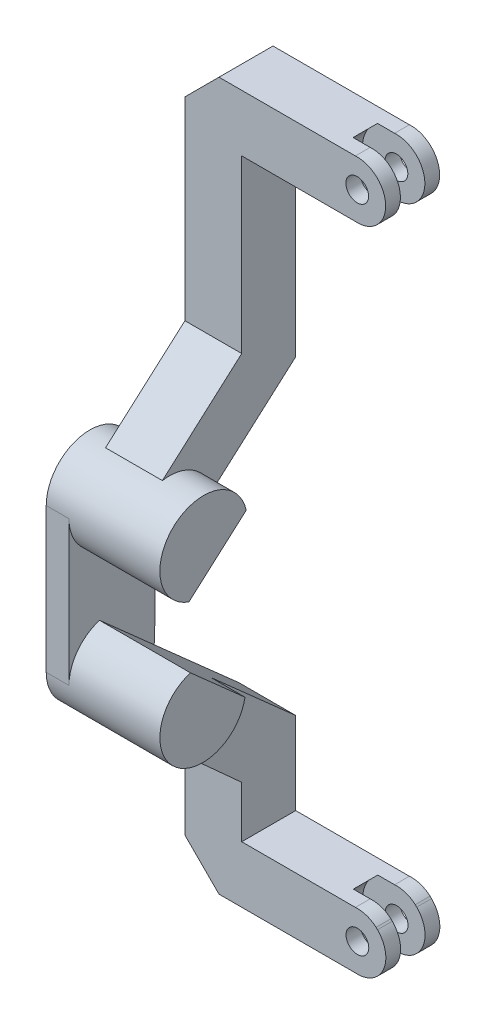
ISO-10303-21;
HEADER;
FILE_DESCRIPTION(('STEP AP214'),'2;1');
FILE_NAME('part.step','',(''),(''),'','','');
FILE_SCHEMA(('AUTOMOTIVE_DESIGN { 1 0 10303 214 1 1 1 1 }'));
ENDSEC;
DATA;
#1=APPLICATION_CONTEXT('core data for automotive mechanical design processes');
#2=APPLICATION_PROTOCOL_DEFINITION('international standard','automotive_design',2000,#1);
#3=PRODUCT_CONTEXT('',#1,'mechanical');
#4=PRODUCT('Part','Part','',(#3));
#5=PRODUCT_RELATED_PRODUCT_CATEGORY('part','',(#4));
#6=PRODUCT_DEFINITION_FORMATION('','',#4);
#7=PRODUCT_DEFINITION_CONTEXT('part definition',#1,'design');
#8=PRODUCT_DEFINITION('design','',#6,#7);
#9=PRODUCT_DEFINITION_SHAPE('','',#8);
#10=(LENGTH_UNIT() NAMED_UNIT(*) SI_UNIT(.MILLI.,.METRE.));
#11=(NAMED_UNIT(*) PLANE_ANGLE_UNIT() SI_UNIT($,.RADIAN.));
#12=(NAMED_UNIT(*) SI_UNIT($,.STERADIAN.) SOLID_ANGLE_UNIT());
#13=UNCERTAINTY_MEASURE_WITH_UNIT(LENGTH_MEASURE(1.E-05),#10,'distance_accuracy_value','');
#14=(GEOMETRIC_REPRESENTATION_CONTEXT(3) GLOBAL_UNCERTAINTY_ASSIGNED_CONTEXT((#13)) GLOBAL_UNIT_ASSIGNED_CONTEXT((#10,
#11,#12)) REPRESENTATION_CONTEXT('',''));
#15=CARTESIAN_POINT('',(0.,0.,0.));
#16=DIRECTION('',(0.,0.,1.));
#17=DIRECTION('',(1.,0.,0.));
#18=AXIS2_PLACEMENT_3D('',#15,#16,#17);
#19=CARTESIAN_POINT('',(5.16132028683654,-99.5512725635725,-13.6669274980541));
#20=DIRECTION('',(0.,0.,1.));
#21=DIRECTION('',(1.,0.,0.));
#22=AXIS2_PLACEMENT_3D('',#19,#20,#21);
#23=CYLINDRICAL_SURFACE('',#22,2.5);
#24=DIRECTION('',(0.,0.,1.));
#25=VECTOR('',#24,1.);
#26=CARTESIAN_POINT('',(6.92908723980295,-101.319039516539,-13.6669274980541));
#27=LINE('',#26,#25);
#28=CARTESIAN_POINT('',(6.92908723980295,-101.319039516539,1.2));
#29=VERTEX_POINT('',#28);
#30=CARTESIAN_POINT('',(6.92908723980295,-101.319039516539,2.49999999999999));
#31=VERTEX_POINT('',#30);
#32=EDGE_CURVE('E11',#29,#31,#27,.T.);
#33=ORIENTED_EDGE('',*,*,#32,.F.);
#34=CARTESIAN_POINT('',(5.16132028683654,-99.5512725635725,1.2));
#35=DIRECTION('',(0.,0.,-1.));
#36=DIRECTION('',(-1.,0.,0.));
#37=AXIS2_PLACEMENT_3D('',#34,#35,#36);
#38=CIRCLE('',#37,2.5);
#39=CARTESIAN_POINT('',(5.,-97.0564828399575,1.2));
#40=VERTEX_POINT('',#39);
#41=EDGE_CURVE('E686',#40,#29,#38,.T.);
#42=ORIENTED_EDGE('',*,*,#41,.F.);
#43=DIRECTION('',(0.,0.,1.));
#44=VECTOR('',#43,1.);
#45=CARTESIAN_POINT('',(5.,-97.0564828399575,-13.6669274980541));
#46=LINE('',#45,#44);
#47=CARTESIAN_POINT('',(5.,-97.0564828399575,2.49999999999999));
#48=VERTEX_POINT('',#47);
#49=EDGE_CURVE('E40',#48,#40,#46,.F.);
#50=ORIENTED_EDGE('',*,*,#49,.F.);
#51=CARTESIAN_POINT('',(5.16132028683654,-99.5512725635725,2.49999999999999));
#52=DIRECTION('',(0.,0.,1.));
#53=DIRECTION('',(1.,0.,0.));
#54=AXIS2_PLACEMENT_3D('',#51,#52,#53);
#55=CIRCLE('',#54,2.5);
#56=EDGE_CURVE('E332',#31,#48,#55,.T.);
#57=ORIENTED_EDGE('',*,*,#56,.F.);
#58=EDGE_LOOP('',(#33,#42,#50,#57));
#59=FACE_BOUND('',#58,.T.);
#60=ADVANCED_FACE('F36',(#59),#23,.T.);
#61=CARTESIAN_POINT('',(5.16132028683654,-99.5512725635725,-13.6669274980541));
#62=DIRECTION('',(0.,0.,1.));
#63=DIRECTION('',(1.,0.,0.));
#64=AXIS2_PLACEMENT_3D('',#61,#62,#63);
#65=CYLINDRICAL_SURFACE('',#64,1.);
#66=CARTESIAN_POINT('',(5.16132028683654,-99.5512725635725,2.49999999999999));
#67=DIRECTION('',(0.,0.,1.));
#68=DIRECTION('',(1.,0.,0.));
#69=AXIS2_PLACEMENT_3D('',#66,#67,#68);
#70=CIRCLE('',#69,1.);
#71=CARTESIAN_POINT('',(6.16132028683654,-99.5512725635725,2.49999999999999));
#72=VERTEX_POINT('',#71);
#73=EDGE_CURVE('E45',#72,#72,#70,.T.);
#74=ORIENTED_EDGE('',*,*,#73,.T.);
#75=EDGE_LOOP('',(#74));
#76=FACE_BOUND('',#75,.T.);
#77=CARTESIAN_POINT('',(5.16132028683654,-99.5512725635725,1.2));
#78=DIRECTION('',(0.,0.,-1.));
#79=DIRECTION('',(-1.,0.,0.));
#80=AXIS2_PLACEMENT_3D('',#77,#78,#79);
#81=CIRCLE('',#80,1.);
#82=CARTESIAN_POINT('',(4.16132028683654,-99.5512725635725,1.2));
#83=VERTEX_POINT('',#82);
#84=EDGE_CURVE('E682',#83,#83,#81,.F.);
#85=ORIENTED_EDGE('',*,*,#84,.F.);
#86=EDGE_LOOP('',(#85));
#87=FACE_BOUND('',#86,.T.);
#88=ADVANCED_FACE('F340',(#76,#87),#65,.F.);
#89=CARTESIAN_POINT('',(6.92908723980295,-101.319039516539,-13.6669274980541));
#90=DIRECTION('',(0.707106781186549,-0.707106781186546,0.));
#91=DIRECTION('',(0.707106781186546,0.707106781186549,0.));
#92=AXIS2_PLACEMENT_3D('',#89,#90,#91);
#93=PLANE('',#92);
#94=DIRECTION('',(0.,0.,1.));
#95=VECTOR('',#94,1.);
#96=CARTESIAN_POINT('',(6.81501657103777,-101.433110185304,-4.99601319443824));
#97=LINE('',#96,#95);
#98=CARTESIAN_POINT('',(6.81501657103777,-101.433110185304,1.2));
#99=VERTEX_POINT('',#98);
#100=CARTESIAN_POINT('',(6.81501657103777,-101.433110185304,2.49999999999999));
#101=VERTEX_POINT('',#100);
#102=EDGE_CURVE('E621',#99,#101,#97,.T.);
#103=ORIENTED_EDGE('',*,*,#102,.F.);
#104=DIRECTION('',(-0.707106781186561,-0.707106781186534,0.));
#105=VECTOR('',#104,1.);
#106=CARTESIAN_POINT('',(6.92908723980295,-101.319039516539,1.2));
#107=LINE('',#106,#105);
#108=EDGE_CURVE('E53',#29,#99,#107,.T.);
#109=ORIENTED_EDGE('',*,*,#108,.F.);
#110=ORIENTED_EDGE('',*,*,#32,.T.);
#111=DIRECTION('',(0.707106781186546,0.707106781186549,0.));
#112=VECTOR('',#111,1.);
#113=CARTESIAN_POINT('',(6.92908723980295,-101.319039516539,2.49999999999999));
#114=LINE('',#113,#112);
#115=EDGE_CURVE('E335',#101,#31,#114,.T.);
#116=ORIENTED_EDGE('',*,*,#115,.F.);
#117=EDGE_LOOP('',(#103,#109,#110,#116));
#118=FACE_BOUND('',#117,.T.);
#119=ADVANCED_FACE('F364',(#118),#93,.T.);
#120=CARTESIAN_POINT('',(5.16132028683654,-99.5512725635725,-4.99601319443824));
#121=DIRECTION('',(0.,0.,1.));
#122=DIRECTION('',(1.,0.,0.));
#123=AXIS2_PLACEMENT_3D('',#120,#121,#122);
#124=CYLINDRICAL_SURFACE('',#123,2.50519944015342);
#125=CARTESIAN_POINT('',(5.16132028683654,-99.5512725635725,1.2));
#126=DIRECTION('',(0.,0.,-1.));
#127=DIRECTION('',(-1.,0.,0.));
#128=AXIS2_PLACEMENT_3D('',#125,#126,#127);
#129=CIRCLE('',#128,2.50519944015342);
#130=CARTESIAN_POINT('',(5.,-102.051272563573,1.2));
#131=VERTEX_POINT('',#130);
#132=EDGE_CURVE('E299',#99,#131,#129,.T.);
#133=ORIENTED_EDGE('',*,*,#132,.F.);
#134=ORIENTED_EDGE('',*,*,#102,.T.);
#135=CARTESIAN_POINT('',(5.16132028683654,-99.5512725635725,2.49999999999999));
#136=DIRECTION('',(0.,0.,-1.));
#137=DIRECTION('',(1.,0.,0.));
#138=AXIS2_PLACEMENT_3D('',#135,#136,#137);
#139=CIRCLE('',#138,2.50519944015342);
#140=CARTESIAN_POINT('',(5.,-102.051272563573,2.49999999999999));
#141=VERTEX_POINT('',#140);
#142=EDGE_CURVE('E321',#101,#141,#139,.T.);
#143=ORIENTED_EDGE('',*,*,#142,.T.);
#144=DIRECTION('',(0.,0.,-1.));
#145=VECTOR('',#144,1.);
#146=CARTESIAN_POINT('',(5.,-102.051272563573,0.));
#147=LINE('',#146,#145);
#148=EDGE_CURVE('E312',#141,#131,#147,.T.);
#149=ORIENTED_EDGE('',*,*,#148,.T.);
#150=EDGE_LOOP('',(#133,#134,#143,#149));
#151=FACE_BOUND('',#150,.T.);
#152=ADVANCED_FACE('F319',(#151),#124,.T.);
#153=CARTESIAN_POINT('',(5.17786708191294,-156.809184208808,-12.3515503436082));
#154=DIRECTION('',(0.,0.,1.));
#155=DIRECTION('',(1.,0.,0.));
#156=AXIS2_PLACEMENT_3D('',#153,#154,#155);
#157=CYLINDRICAL_SURFACE('',#156,1.00000000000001);
#158=CARTESIAN_POINT('',(5.17786708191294,-156.809184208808,2.49999999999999));
#159=DIRECTION('',(0.,0.,1.));
#160=DIRECTION('',(1.,0.,0.));
#161=AXIS2_PLACEMENT_3D('',#158,#159,#160);
#162=CIRCLE('',#161,1.);
#163=CARTESIAN_POINT('',(6.17786708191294,-156.809184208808,2.49999999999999));
#164=VERTEX_POINT('',#163);
#165=EDGE_CURVE('E428',#164,#164,#162,.T.);
#166=ORIENTED_EDGE('',*,*,#165,.T.);
#167=EDGE_LOOP('',(#166));
#168=FACE_BOUND('',#167,.T.);
#169=CARTESIAN_POINT('',(5.17786708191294,-156.809184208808,1.2));
#170=DIRECTION('',(0.,0.,-1.));
#171=DIRECTION('',(-1.,0.,0.));
#172=AXIS2_PLACEMENT_3D('',#169,#170,#171);
#173=CIRCLE('',#172,1.00000000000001);
#174=CARTESIAN_POINT('',(4.17786708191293,-156.809184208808,1.2));
#175=VERTEX_POINT('',#174);
#176=EDGE_CURVE('E667',#175,#175,#173,.F.);
#177=ORIENTED_EDGE('',*,*,#176,.F.);
#178=EDGE_LOOP('',(#177));
#179=FACE_BOUND('',#178,.T.);
#180=ADVANCED_FACE('F701',(#168,#179),#157,.F.);
#181=CARTESIAN_POINT('',(5.17786708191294,-156.809184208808,-12.3515503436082));
#182=DIRECTION('',(0.,0.,1.));
#183=DIRECTION('',(1.,0.,0.));
#184=AXIS2_PLACEMENT_3D('',#181,#182,#183);
#185=CYLINDRICAL_SURFACE('',#184,2.50000000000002);
#186=DIRECTION('',(0.,0.,1.));
#187=VECTOR('',#186,1.);
#188=CARTESIAN_POINT('',(5.00000000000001,-159.302848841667,-12.3515503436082));
#189=LINE('',#188,#187);
#190=CARTESIAN_POINT('',(5.00000000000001,-159.302848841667,1.2));
#191=VERTEX_POINT('',#190);
#192=CARTESIAN_POINT('',(5.00000000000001,-159.302848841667,2.49999999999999));
#193=VERTEX_POINT('',#192);
#194=EDGE_CURVE('E441',#191,#193,#189,.T.);
#195=ORIENTED_EDGE('',*,*,#194,.F.);
#196=CARTESIAN_POINT('',(5.17786708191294,-156.809184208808,1.2));
#197=DIRECTION('',(0.,0.,-1.));
#198=DIRECTION('',(-1.,0.,0.));
#199=AXIS2_PLACEMENT_3D('',#196,#197,#198);
#200=CIRCLE('',#199,2.50000000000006);
#201=CARTESIAN_POINT('',(6.9456340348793,-155.041417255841,1.2));
#202=VERTEX_POINT('',#201);
#203=EDGE_CURVE('E673',#202,#191,#200,.T.);
#204=ORIENTED_EDGE('',*,*,#203,.F.);
#205=DIRECTION('',(0.,0.,1.));
#206=VECTOR('',#205,1.);
#207=CARTESIAN_POINT('',(6.9456340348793,-155.041417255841,-12.3515503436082));
#208=LINE('',#207,#206);
#209=CARTESIAN_POINT('',(6.9456340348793,-155.041417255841,2.5));
#210=VERTEX_POINT('',#209);
#211=EDGE_CURVE('E423',#202,#210,#208,.T.);
#212=ORIENTED_EDGE('',*,*,#211,.T.);
#213=CARTESIAN_POINT('',(5.17786708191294,-156.809184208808,2.49999999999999));
#214=DIRECTION('',(0.,0.,1.));
#215=DIRECTION('',(1.,0.,0.));
#216=AXIS2_PLACEMENT_3D('',#213,#214,#215);
#217=CIRCLE('',#216,2.50000000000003);
#218=EDGE_CURVE('E429',#193,#210,#217,.T.);
#219=ORIENTED_EDGE('',*,*,#218,.F.);
#220=EDGE_LOOP('',(#195,#204,#212,#219));
#221=FACE_BOUND('',#220,.T.);
#222=ADVANCED_FACE('F705',(#221),#185,.T.);
#223=CARTESIAN_POINT('',(5.,-153.095783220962,-12.3515503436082));
#224=DIRECTION('',(0.70710678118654,0.707106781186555,0.));
#225=DIRECTION('',(-0.707106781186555,0.70710678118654,0.));
#226=AXIS2_PLACEMENT_3D('',#223,#224,#225);
#227=PLANE('',#226);
#228=ORIENTED_EDGE('',*,*,#211,.F.);
#229=DIRECTION('',(0.707106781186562,-0.707106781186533,0.));
#230=VECTOR('',#229,1.);
#231=CARTESIAN_POINT('',(6.81986301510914,-154.915646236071,1.2));
#232=LINE('',#231,#230);
#233=CARTESIAN_POINT('',(6.81986301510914,-154.915646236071,1.2));
#234=VERTEX_POINT('',#233);
#235=EDGE_CURVE('E675',#234,#202,#232,.T.);
#236=ORIENTED_EDGE('',*,*,#235,.F.);
#237=DIRECTION('',(0.,0.,1.));
#238=VECTOR('',#237,1.);
#239=CARTESIAN_POINT('',(6.81986301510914,-154.915646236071,-4.99601319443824));
#240=LINE('',#239,#238);
#241=CARTESIAN_POINT('',(6.81986301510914,-154.915646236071,2.5));
#242=VERTEX_POINT('',#241);
#243=EDGE_CURVE('E452',#242,#234,#240,.F.);
#244=ORIENTED_EDGE('',*,*,#243,.F.);
#245=DIRECTION('',(-0.707106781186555,0.70710678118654,0.));
#246=VECTOR('',#245,1.);
#247=CARTESIAN_POINT('',(5.,-153.095783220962,2.5));
#248=LINE('',#247,#246);
#249=EDGE_CURVE('E420',#210,#242,#248,.T.);
#250=ORIENTED_EDGE('',*,*,#249,.F.);
#251=EDGE_LOOP('',(#228,#236,#244,#250));
#252=FACE_BOUND('',#251,.T.);
#253=ADVANCED_FACE('F998',(#252),#227,.T.);
#254=CARTESIAN_POINT('',(5.17786708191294,-156.809184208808,-4.99601319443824));
#255=DIRECTION('',(0.,0.,1.));
#256=DIRECTION('',(1.,0.,0.));
#257=AXIS2_PLACEMENT_3D('',#254,#255,#256);
#258=CYLINDRICAL_SURFACE('',#257,2.50631935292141);
#259=CARTESIAN_POINT('',(5.17786708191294,-156.809184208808,1.2));
#260=DIRECTION('',(0.,0.,-1.));
#261=DIRECTION('',(-1.,0.,0.));
#262=AXIS2_PLACEMENT_3D('',#259,#260,#261);
#263=CIRCLE('',#262,2.5063193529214);
#264=CARTESIAN_POINT('',(5.00000000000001,-154.309184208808,1.2));
#265=VERTEX_POINT('',#264);
#266=EDGE_CURVE('E677',#265,#234,#263,.T.);
#267=ORIENTED_EDGE('',*,*,#266,.F.);
#268=DIRECTION('',(0.,0.,-1.));
#269=VECTOR('',#268,1.);
#270=CARTESIAN_POINT('',(5.00000000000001,-154.309184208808,-20.621363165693));
#271=LINE('',#270,#269);
#272=CARTESIAN_POINT('',(5.00000000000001,-154.309184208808,2.49999999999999));
#273=VERTEX_POINT('',#272);
#274=EDGE_CURVE('E425',#273,#265,#271,.T.);
#275=ORIENTED_EDGE('',*,*,#274,.F.);
#276=CARTESIAN_POINT('',(5.17786708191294,-156.809184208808,2.49999999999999));
#277=DIRECTION('',(0.,0.,-1.));
#278=DIRECTION('',(-1.,0.,0.));
#279=AXIS2_PLACEMENT_3D('',#276,#277,#278);
#280=CIRCLE('',#279,2.50631935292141);
#281=EDGE_CURVE('E404',#273,#242,#280,.T.);
#282=ORIENTED_EDGE('',*,*,#281,.T.);
#283=ORIENTED_EDGE('',*,*,#243,.T.);
#284=EDGE_LOOP('',(#267,#275,#282,#283));
#285=FACE_BOUND('',#284,.T.);
#286=ADVANCED_FACE('F378',(#285),#258,.T.);
#287=CARTESIAN_POINT('',(5.17786708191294,-156.809184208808,-2.25));
#288=DIRECTION('',(0.,0.,-1.));
#289=DIRECTION('',(0.,1.,0.));
#290=AXIS2_PLACEMENT_3D('',#287,#288,#289);
#291=CIRCLE('',#290,1.00000000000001);
#292=CARTESIAN_POINT('',(5.17786708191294,-155.809184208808,-2.25));
#293=VERTEX_POINT('',#292);
#294=EDGE_CURVE('E438',#293,#293,#291,.F.);
#295=ORIENTED_EDGE('',*,*,#294,.F.);
#296=EDGE_LOOP('',(#295));
#297=FACE_BOUND('',#296,.T.);
#298=CARTESIAN_POINT('',(5.17786708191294,-156.809184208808,-0.95));
#299=DIRECTION('',(0.,0.,1.));
#300=DIRECTION('',(1.,0.,0.));
#301=AXIS2_PLACEMENT_3D('',#298,#299,#300);
#302=CIRCLE('',#301,1.00000000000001);
#303=CARTESIAN_POINT('',(6.17786708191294,-156.809184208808,-0.95));
#304=VERTEX_POINT('',#303);
#305=EDGE_CURVE('E650',#304,#304,#302,.F.);
#306=ORIENTED_EDGE('',*,*,#305,.F.);
#307=EDGE_LOOP('',(#306));
#308=FACE_BOUND('',#307,.T.);
#309=ADVANCED_FACE('F708',(#297,#308),#157,.F.);
#310=DIRECTION('',(0.,0.,1.));
#311=VECTOR('',#310,1.);
#312=CARTESIAN_POINT('',(6.9456340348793,-155.041417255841,-12.3515503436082));
#313=LINE('',#312,#311);
#314=CARTESIAN_POINT('',(6.9456340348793,-155.041417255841,-2.25));
#315=VERTEX_POINT('',#314);
#316=CARTESIAN_POINT('',(6.9456340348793,-155.041417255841,-0.95));
#317=VERTEX_POINT('',#316);
#318=EDGE_CURVE('E442',#315,#317,#313,.T.);
#319=ORIENTED_EDGE('',*,*,#318,.T.);
#320=CARTESIAN_POINT('',(5.17786708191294,-156.809184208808,-0.95));
#321=DIRECTION('',(0.,0.,1.));
#322=DIRECTION('',(1.,0.,0.));
#323=AXIS2_PLACEMENT_3D('',#320,#321,#322);
#324=CIRCLE('',#323,2.50000000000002);
#325=CARTESIAN_POINT('',(5.00000000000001,-159.302848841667,-0.95));
#326=VERTEX_POINT('',#325);
#327=EDGE_CURVE('E655',#326,#317,#324,.T.);
#328=ORIENTED_EDGE('',*,*,#327,.F.);
#329=CARTESIAN_POINT('',(5.00000000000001,-159.302848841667,-2.25));
#330=VERTEX_POINT('',#329);
#331=EDGE_CURVE('E449',#330,#326,#189,.T.);
#332=ORIENTED_EDGE('',*,*,#331,.F.);
#333=CARTESIAN_POINT('',(5.17786708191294,-156.809184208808,-2.25));
#334=DIRECTION('',(0.,0.,-1.));
#335=DIRECTION('',(0.,1.,0.));
#336=AXIS2_PLACEMENT_3D('',#333,#334,#335);
#337=CIRCLE('',#336,2.50000000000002);
#338=EDGE_CURVE('E445',#330,#315,#337,.F.);
#339=ORIENTED_EDGE('',*,*,#338,.T.);
#340=EDGE_LOOP('',(#319,#328,#332,#339));
#341=FACE_BOUND('',#340,.T.);
#342=ADVANCED_FACE('F1001',(#341),#185,.T.);
#343=CARTESIAN_POINT('',(5.,-153.095783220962,-12.3515503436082));
#344=DIRECTION('',(0.70710678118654,0.707106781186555,0.));
#345=DIRECTION('',(-0.707106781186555,0.70710678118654,0.));
#346=AXIS2_PLACEMENT_3D('',#343,#344,#345);
#347=PLANE('',#346);
#348=DIRECTION('',(0.,0.,1.));
#349=VECTOR('',#348,1.);
#350=CARTESIAN_POINT('',(6.81986301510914,-154.915646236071,-4.99601319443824));
#351=LINE('',#350,#349);
#352=CARTESIAN_POINT('',(6.81986301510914,-154.915646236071,-0.95));
#353=VERTEX_POINT('',#352);
#354=CARTESIAN_POINT('',(6.81986301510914,-154.915646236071,-2.25));
#355=VERTEX_POINT('',#354);
#356=EDGE_CURVE('E414',#353,#355,#351,.F.);
#357=ORIENTED_EDGE('',*,*,#356,.F.);
#358=DIRECTION('',(-0.707106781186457,0.707106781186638,0.));
#359=VECTOR('',#358,1.);
#360=CARTESIAN_POINT('',(6.9456340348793,-155.041417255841,-0.95));
#361=LINE('',#360,#359);
#362=EDGE_CURVE('E653',#317,#353,#361,.T.);
#363=ORIENTED_EDGE('',*,*,#362,.F.);
#364=ORIENTED_EDGE('',*,*,#318,.F.);
#365=DIRECTION('',(-0.707106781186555,0.70710678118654,0.));
#366=VECTOR('',#365,1.);
#367=CARTESIAN_POINT('',(5.,-153.095783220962,-2.25));
#368=LINE('',#367,#366);
#369=EDGE_CURVE('E437',#315,#355,#368,.T.);
#370=ORIENTED_EDGE('',*,*,#369,.T.);
#371=EDGE_LOOP('',(#357,#363,#364,#370));
#372=FACE_BOUND('',#371,.T.);
#373=ADVANCED_FACE('F375',(#372),#347,.T.);
#374=CARTESIAN_POINT('',(5.17786708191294,-156.809184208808,-0.95));
#375=DIRECTION('',(0.,0.,1.));
#376=DIRECTION('',(1.,0.,0.));
#377=AXIS2_PLACEMENT_3D('',#374,#375,#376);
#378=CIRCLE('',#377,2.50631935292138);
#379=CARTESIAN_POINT('',(5.00000000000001,-154.309184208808,-0.95));
#380=VERTEX_POINT('',#379);
#381=EDGE_CURVE('E665',#353,#380,#378,.T.);
#382=ORIENTED_EDGE('',*,*,#381,.F.);
#383=ORIENTED_EDGE('',*,*,#356,.T.);
#384=CARTESIAN_POINT('',(5.17786708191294,-156.809184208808,-2.25));
#385=DIRECTION('',(0.,0.,-1.));
#386=DIRECTION('',(0.,1.,0.));
#387=AXIS2_PLACEMENT_3D('',#384,#385,#386);
#388=CIRCLE('',#387,2.50631935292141);
#389=CARTESIAN_POINT('',(5.00000000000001,-154.309184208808,-2.25));
#390=VERTEX_POINT('',#389);
#391=EDGE_CURVE('E411',#390,#355,#388,.T.);
#392=ORIENTED_EDGE('',*,*,#391,.F.);
#393=DIRECTION('',(0.,0.,1.));
#394=VECTOR('',#393,1.);
#395=CARTESIAN_POINT('',(5.00000000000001,-154.309184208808,0.));
#396=LINE('',#395,#394);
#397=EDGE_CURVE('E432',#390,#380,#396,.T.);
#398=ORIENTED_EDGE('',*,*,#397,.T.);
#399=EDGE_LOOP('',(#382,#383,#392,#398));
#400=FACE_BOUND('',#399,.T.);
#401=ADVANCED_FACE('F368',(#400),#258,.T.);
#402=CARTESIAN_POINT('',(5.,-97.0564828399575,-0.95));
#403=VERTEX_POINT('',#402);
#404=CARTESIAN_POINT('',(5.,-97.0564828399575,-2.24999999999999));
#405=VERTEX_POINT('',#404);
#406=EDGE_CURVE('E322',#403,#405,#46,.F.);
#407=ORIENTED_EDGE('',*,*,#406,.F.);
#408=CARTESIAN_POINT('',(5.16132028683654,-99.5512725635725,-0.95));
#409=DIRECTION('',(0.,0.,1.));
#410=DIRECTION('',(1.,0.,0.));
#411=AXIS2_PLACEMENT_3D('',#408,#409,#410);
#412=CIRCLE('',#411,2.5);
#413=CARTESIAN_POINT('',(6.92908723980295,-101.319039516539,-0.95));
#414=VERTEX_POINT('',#413);
#415=EDGE_CURVE('E383',#414,#403,#412,.T.);
#416=ORIENTED_EDGE('',*,*,#415,.F.);
#417=DIRECTION('',(0.,0.,1.));
#418=VECTOR('',#417,1.);
#419=CARTESIAN_POINT('',(6.92908723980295,-101.319039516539,-13.6669274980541));
#420=LINE('',#419,#418);
#421=CARTESIAN_POINT('',(6.92908723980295,-101.319039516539,-2.25));
#422=VERTEX_POINT('',#421);
#423=EDGE_CURVE('E625',#422,#414,#420,.T.);
#424=ORIENTED_EDGE('',*,*,#423,.F.);
#425=CARTESIAN_POINT('',(5.16132028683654,-99.5512725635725,-2.24999999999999));
#426=DIRECTION('',(0.,0.,-1.));
#427=DIRECTION('',(0.,1.,0.));
#428=AXIS2_PLACEMENT_3D('',#425,#426,#427);
#429=CIRCLE('',#428,2.5);
#430=EDGE_CURVE('E386',#422,#405,#429,.F.);
#431=ORIENTED_EDGE('',*,*,#430,.T.);
#432=EDGE_LOOP('',(#407,#416,#424,#431));
#433=FACE_BOUND('',#432,.T.);
#434=ADVANCED_FACE('F38',(#433),#23,.T.);
#435=CARTESIAN_POINT('',(5.16132028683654,-99.5512725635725,-2.24999999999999));
#436=DIRECTION('',(0.,0.,-1.));
#437=DIRECTION('',(0.,1.,0.));
#438=AXIS2_PLACEMENT_3D('',#435,#436,#437);
#439=CIRCLE('',#438,0.999999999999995);
#440=CARTESIAN_POINT('',(5.16132028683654,-98.5512725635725,-2.24999999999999));
#441=VERTEX_POINT('',#440);
#442=EDGE_CURVE('E323',#441,#441,#439,.F.);
#443=ORIENTED_EDGE('',*,*,#442,.F.);
#444=EDGE_LOOP('',(#443));
#445=FACE_BOUND('',#444,.T.);
#446=CARTESIAN_POINT('',(5.16132028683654,-99.5512725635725,-0.95));
#447=DIRECTION('',(0.,0.,1.));
#448=DIRECTION('',(1.,0.,0.));
#449=AXIS2_PLACEMENT_3D('',#446,#447,#448);
#450=CIRCLE('',#449,1.);
#451=CARTESIAN_POINT('',(6.16132028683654,-99.5512725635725,-0.95));
#452=VERTEX_POINT('',#451);
#453=EDGE_CURVE('E401',#452,#452,#450,.F.);
#454=ORIENTED_EDGE('',*,*,#453,.F.);
#455=EDGE_LOOP('',(#454));
#456=FACE_BOUND('',#455,.T.);
#457=ADVANCED_FACE('F365',(#445,#456),#65,.F.);
#458=CARTESIAN_POINT('',(6.92908723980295,-101.319039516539,-13.6669274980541));
#459=DIRECTION('',(0.707106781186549,-0.707106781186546,0.));
#460=DIRECTION('',(0.707106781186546,0.707106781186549,0.));
#461=AXIS2_PLACEMENT_3D('',#458,#459,#460);
#462=PLANE('',#461);
#463=ORIENTED_EDGE('',*,*,#423,.T.);
#464=DIRECTION('',(0.707106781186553,0.707106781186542,0.));
#465=VECTOR('',#464,1.);
#466=CARTESIAN_POINT('',(6.81501657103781,-101.433110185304,-0.95));
#467=LINE('',#466,#465);
#468=CARTESIAN_POINT('',(6.81501657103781,-101.433110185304,-0.95));
#469=VERTEX_POINT('',#468);
#470=EDGE_CURVE('E406',#469,#414,#467,.T.);
#471=ORIENTED_EDGE('',*,*,#470,.F.);
#472=DIRECTION('',(0.,0.,1.));
#473=VECTOR('',#472,1.);
#474=CARTESIAN_POINT('',(6.81501657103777,-101.433110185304,-4.99601319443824));
#475=LINE('',#474,#473);
#476=CARTESIAN_POINT('',(6.81501657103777,-101.433110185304,-2.24999999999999));
#477=VERTEX_POINT('',#476);
#478=EDGE_CURVE('E618',#477,#469,#475,.T.);
#479=ORIENTED_EDGE('',*,*,#478,.F.);
#480=DIRECTION('',(0.707106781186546,0.707106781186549,0.));
#481=VECTOR('',#480,1.);
#482=CARTESIAN_POINT('',(6.92908723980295,-101.319039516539,-2.25));
#483=LINE('',#482,#481);
#484=EDGE_CURVE('E626',#477,#422,#483,.T.);
#485=ORIENTED_EDGE('',*,*,#484,.T.);
#486=EDGE_LOOP('',(#463,#471,#479,#485));
#487=FACE_BOUND('',#486,.T.);
#488=ADVANCED_FACE('F355',(#487),#462,.T.);
#489=CARTESIAN_POINT('',(5.16132028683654,-99.5512725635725,-0.95));
#490=DIRECTION('',(0.,0.,1.));
#491=DIRECTION('',(1.,0.,0.));
#492=AXIS2_PLACEMENT_3D('',#489,#490,#491);
#493=CIRCLE('',#492,2.50519944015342);
#494=CARTESIAN_POINT('',(5.,-102.051272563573,-0.95));
#495=VERTEX_POINT('',#494);
#496=EDGE_CURVE('E639',#495,#469,#493,.T.);
#497=ORIENTED_EDGE('',*,*,#496,.F.);
#498=DIRECTION('',(0.,0.,1.));
#499=VECTOR('',#498,1.);
#500=CARTESIAN_POINT('',(5.,-102.051272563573,-20.621363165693));
#501=LINE('',#500,#499);
#502=CARTESIAN_POINT('',(5.,-102.051272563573,-2.24999999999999));
#503=VERTEX_POINT('',#502);
#504=EDGE_CURVE('E628',#503,#495,#501,.T.);
#505=ORIENTED_EDGE('',*,*,#504,.F.);
#506=CARTESIAN_POINT('',(5.16132028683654,-99.5512725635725,-2.24999999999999));
#507=DIRECTION('',(0.,0.,-1.));
#508=DIRECTION('',(0.,1.,0.));
#509=AXIS2_PLACEMENT_3D('',#506,#507,#508);
#510=CIRCLE('',#509,2.50519944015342);
#511=EDGE_CURVE('E615',#477,#503,#510,.T.);
#512=ORIENTED_EDGE('',*,*,#511,.F.);
#513=ORIENTED_EDGE('',*,*,#478,.T.);
#514=EDGE_LOOP('',(#497,#505,#512,#513));
#515=FACE_BOUND('',#514,.T.);
#516=ADVANCED_FACE('F346',(#515),#124,.T.);
#517=CARTESIAN_POINT('',(5.17944049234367,-97.051338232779,2.49999999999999));
#518=DIRECTION('',(0.,0.,1.));
#519=DIRECTION('',(1.,0.,0.));
#520=AXIS2_PLACEMENT_3D('',#517,#518,#519);
#521=PLANE('',#520);
#522=DIRECTION('',(-1.,0.,0.));
#523=VECTOR('',#522,1.);
#524=CARTESIAN_POINT('',(5.,-97.0564828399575,2.49999999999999));
#525=LINE('',#524,#523);
#526=CARTESIAN_POINT('',(-7.,-97.0564828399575,2.49999999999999));
#527=VERTEX_POINT('',#526);
#528=EDGE_CURVE('E633',#48,#527,#525,.T.);
#529=ORIENTED_EDGE('',*,*,#528,.T.);
#530=DIRECTION('',(-0.707106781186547,-0.707106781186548,0.));
#531=VECTOR('',#530,1.);
#532=CARTESIAN_POINT('',(-7.,-97.0564828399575,2.49999999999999));
#533=LINE('',#532,#531);
#534=CARTESIAN_POINT('',(-10.,-100.056482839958,2.49999999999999));
#535=VERTEX_POINT('',#534);
#536=EDGE_CURVE('E591',#527,#535,#533,.T.);
#537=ORIENTED_EDGE('',*,*,#536,.T.);
#538=DIRECTION('',(0.,-1.,0.));
#539=VECTOR('',#538,1.);
#540=CARTESIAN_POINT('',(-10.,-100.056482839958,2.49999999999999));
#541=LINE('',#540,#539);
#542=CARTESIAN_POINT('',(-10.,-117.112506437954,2.49999999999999));
#543=VERTEX_POINT('',#542);
#544=EDGE_CURVE('E596',#535,#543,#541,.T.);
#545=ORIENTED_EDGE('',*,*,#544,.T.);
#546=DIRECTION('',(-1.,0.,0.));
#547=VECTOR('',#546,1.);
#548=CARTESIAN_POINT('',(-1.55224131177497,-117.112506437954,2.49999999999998));
#549=LINE('',#548,#547);
#550=CARTESIAN_POINT('',(-5.,-117.112506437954,2.49999999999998));
#551=VERTEX_POINT('',#550);
#552=EDGE_CURVE('E505',#551,#543,#549,.T.);
#553=ORIENTED_EDGE('',*,*,#552,.F.);
#554=DIRECTION('',(0.,1.,0.));
#555=VECTOR('',#554,1.);
#556=CARTESIAN_POINT('',(-5.,-102.051272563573,2.49999999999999));
#557=LINE('',#556,#555);
#558=CARTESIAN_POINT('',(-5.,-102.051272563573,2.49999999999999));
#559=VERTEX_POINT('',#558);
#560=EDGE_CURVE('E592',#551,#559,#557,.T.);
#561=ORIENTED_EDGE('',*,*,#560,.T.);
#562=DIRECTION('',(1.,0.,0.));
#563=VECTOR('',#562,1.);
#564=CARTESIAN_POINT('',(5.16132028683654,-102.051272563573,2.49999999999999));
#565=LINE('',#564,#563);
#566=EDGE_CURVE('E326',#559,#141,#565,.T.);
#567=ORIENTED_EDGE('',*,*,#566,.T.);
#568=ORIENTED_EDGE('',*,*,#142,.F.);
#569=ORIENTED_EDGE('',*,*,#115,.T.);
#570=ORIENTED_EDGE('',*,*,#56,.T.);
#571=EDGE_LOOP('',(#529,#537,#545,#553,#561,#567,#568,#569,#570));
#572=FACE_BOUND('',#571,.T.);
#573=ORIENTED_EDGE('',*,*,#73,.F.);
#574=EDGE_LOOP('',(#573));
#575=FACE_BOUND('',#574,.T.);
#576=ADVANCED_FACE('F343',(#572,#575),#521,.T.);
#577=CARTESIAN_POINT('',(-4.81043709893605,-159.305979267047,-2.25));
#578=DIRECTION('',(0.,0.,-1.));
#579=DIRECTION('',(0.,1.,0.));
#580=AXIS2_PLACEMENT_3D('',#577,#578,#579);
#581=PLANE('',#580);
#582=DIRECTION('',(1.,0.,0.));
#583=VECTOR('',#582,1.);
#584=CARTESIAN_POINT('',(5.16132028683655,-102.051272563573,-2.24999999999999));
#585=LINE('',#584,#583);
#586=CARTESIAN_POINT('',(-5.,-102.051272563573,-2.25));
#587=VERTEX_POINT('',#586);
#588=EDGE_CURVE('E330',#587,#503,#585,.T.);
#589=ORIENTED_EDGE('',*,*,#588,.F.);
#590=DIRECTION('',(0.,1.,0.));
#591=VECTOR('',#590,1.);
#592=CARTESIAN_POINT('',(-5.,-102.051272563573,-2.25));
#593=LINE('',#592,#591);
#594=CARTESIAN_POINT('',(-5.,-119.735248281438,-2.25));
#595=VERTEX_POINT('',#594);
#596=EDGE_CURVE('E600',#595,#587,#593,.T.);
#597=ORIENTED_EDGE('',*,*,#596,.F.);
#598=DIRECTION('',(-1.,0.,0.));
#599=VECTOR('',#598,1.);
#600=CARTESIAN_POINT('',(-2.99626187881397,-119.735248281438,-2.25));
#601=LINE('',#600,#599);
#602=CARTESIAN_POINT('',(-10.,-119.735248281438,-2.25));
#603=VERTEX_POINT('',#602);
#604=EDGE_CURVE('E501',#595,#603,#601,.T.);
#605=ORIENTED_EDGE('',*,*,#604,.T.);
#606=DIRECTION('',(0.,-1.,0.));
#607=VECTOR('',#606,1.);
#608=CARTESIAN_POINT('',(-10.,-100.056482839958,-2.25));
#609=LINE('',#608,#607);
#610=CARTESIAN_POINT('',(-10.,-100.056482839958,-2.25));
#611=VERTEX_POINT('',#610);
#612=EDGE_CURVE('E604',#611,#603,#609,.T.);
#613=ORIENTED_EDGE('',*,*,#612,.F.);
#614=DIRECTION('',(-0.707106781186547,-0.707106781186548,0.));
#615=VECTOR('',#614,1.);
#616=CARTESIAN_POINT('',(-7.,-97.0564828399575,-2.25));
#617=LINE('',#616,#615);
#618=CARTESIAN_POINT('',(-7.,-97.0564828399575,-2.25));
#619=VERTEX_POINT('',#618);
#620=EDGE_CURVE('E607',#619,#611,#617,.T.);
#621=ORIENTED_EDGE('',*,*,#620,.F.);
#622=DIRECTION('',(-1.,0.,0.));
#623=VECTOR('',#622,1.);
#624=CARTESIAN_POINT('',(5.,-97.0564828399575,-2.24999999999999));
#625=LINE('',#624,#623);
#626=EDGE_CURVE('E393',#405,#619,#625,.T.);
#627=ORIENTED_EDGE('',*,*,#626,.F.);
#628=ORIENTED_EDGE('',*,*,#430,.F.);
#629=ORIENTED_EDGE('',*,*,#484,.F.);
#630=ORIENTED_EDGE('',*,*,#511,.T.);
#631=EDGE_LOOP('',(#589,#597,#605,#613,#621,#627,#628,#629,#630));
#632=FACE_BOUND('',#631,.T.);
#633=ORIENTED_EDGE('',*,*,#442,.T.);
#634=EDGE_LOOP('',(#633));
#635=FACE_BOUND('',#634,.T.);
#636=ADVANCED_FACE('F345',(#632,#635),#581,.T.);
#637=CARTESIAN_POINT('',(5.16132028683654,-102.051272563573,-20.621363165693));
#638=DIRECTION('',(0.,-1.,0.));
#639=DIRECTION('',(0.,0.,-1.));
#640=AXIS2_PLACEMENT_3D('',#637,#638,#639);
#641=PLANE('',#640);
#642=DIRECTION('',(0.,0.,1.));
#643=VECTOR('',#642,1.);
#644=CARTESIAN_POINT('',(3.50300789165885,-102.051272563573,-0.749999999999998));
#645=LINE('',#644,#643);
#646=CARTESIAN_POINT('',(3.50300789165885,-102.051272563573,-0.95));
#647=VERTEX_POINT('',#646);
#648=CARTESIAN_POINT('',(3.50300789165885,-102.051272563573,1.2));
#649=VERTEX_POINT('',#648);
#650=EDGE_CURVE('E314',#647,#649,#645,.T.);
#651=ORIENTED_EDGE('',*,*,#650,.T.);
#652=DIRECTION('',(-1.,0.,0.));
#653=VECTOR('',#652,1.);
#654=CARTESIAN_POINT('',(5.,-102.051272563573,1.2));
#655=LINE('',#654,#653);
#656=EDGE_CURVE('E304',#131,#649,#655,.T.);
#657=ORIENTED_EDGE('',*,*,#656,.F.);
#658=ORIENTED_EDGE('',*,*,#148,.F.);
#659=ORIENTED_EDGE('',*,*,#566,.F.);
#660=DIRECTION('',(0.,0.,1.));
#661=VECTOR('',#660,1.);
#662=CARTESIAN_POINT('',(-5.,-102.051272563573,-18.9455209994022));
#663=LINE('',#662,#661);
#664=EDGE_CURVE('E603',#587,#559,#663,.T.);
#665=ORIENTED_EDGE('',*,*,#664,.F.);
#666=ORIENTED_EDGE('',*,*,#588,.T.);
#667=ORIENTED_EDGE('',*,*,#504,.T.);
#668=DIRECTION('',(1.,0.,0.));
#669=VECTOR('',#668,1.);
#670=CARTESIAN_POINT('',(3.50300789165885,-102.051272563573,-0.95));
#671=LINE('',#670,#669);
#672=EDGE_CURVE('E644',#647,#495,#671,.T.);
#673=ORIENTED_EDGE('',*,*,#672,.F.);
#674=EDGE_LOOP('',(#651,#657,#658,#659,#665,#666,#667,#673));
#675=FACE_BOUND('',#674,.T.);
#676=ADVANCED_FACE('F311',(#675),#641,.T.);
#677=CARTESIAN_POINT('',(5.,-97.0564828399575,-20.621363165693));
#678=DIRECTION('',(0.,1.,0.));
#679=DIRECTION('',(0.,0.,1.));
#680=AXIS2_PLACEMENT_3D('',#677,#678,#679);
#681=PLANE('',#680);
#682=DIRECTION('',(1.,0.,0.));
#683=VECTOR('',#682,1.);
#684=CARTESIAN_POINT('',(3.49517976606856,-97.0564828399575,1.2));
#685=LINE('',#684,#683);
#686=CARTESIAN_POINT('',(3.49517976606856,-97.0564828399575,1.2));
#687=VERTEX_POINT('',#686);
#688=EDGE_CURVE('E688',#687,#40,#685,.T.);
#689=ORIENTED_EDGE('',*,*,#688,.F.);
#690=DIRECTION('',(0.,0.,1.));
#691=VECTOR('',#690,1.);
#692=CARTESIAN_POINT('',(3.49517976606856,-97.0564828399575,-0.749999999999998));
#693=LINE('',#692,#691);
#694=CARTESIAN_POINT('',(3.49517976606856,-97.0564828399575,-0.95));
#695=VERTEX_POINT('',#694);
#696=EDGE_CURVE('E397',#687,#695,#693,.F.);
#697=ORIENTED_EDGE('',*,*,#696,.T.);
#698=DIRECTION('',(-1.,0.,0.));
#699=VECTOR('',#698,1.);
#700=CARTESIAN_POINT('',(5.,-97.0564828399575,-0.95));
#701=LINE('',#700,#699);
#702=EDGE_CURVE('E396',#403,#695,#701,.T.);
#703=ORIENTED_EDGE('',*,*,#702,.F.);
#704=ORIENTED_EDGE('',*,*,#406,.T.);
#705=ORIENTED_EDGE('',*,*,#626,.T.);
#706=DIRECTION('',(0.,0.,1.));
#707=VECTOR('',#706,1.);
#708=CARTESIAN_POINT('',(-7.,-97.0564828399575,-18.9455209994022));
#709=LINE('',#708,#707);
#710=EDGE_CURVE('E595',#619,#527,#709,.T.);
#711=ORIENTED_EDGE('',*,*,#710,.T.);
#712=ORIENTED_EDGE('',*,*,#528,.F.);
#713=ORIENTED_EDGE('',*,*,#49,.T.);
#714=EDGE_LOOP('',(#689,#697,#703,#704,#705,#711,#712,#713));
#715=FACE_BOUND('',#714,.T.);
#716=ADVANCED_FACE('F391',(#715),#681,.T.);
#717=CARTESIAN_POINT('',(5.16132028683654,-99.5512725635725,-0.749999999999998));
#718=DIRECTION('',(0.,0.,1.));
#719=DIRECTION('',(0.,-1.,0.));
#720=AXIS2_PLACEMENT_3D('',#717,#718,#719);
#721=CYLINDRICAL_SURFACE('',#720,3.);
#722=ORIENTED_EDGE('',*,*,#650,.F.);
#723=CARTESIAN_POINT('',(5.16132028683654,-99.5512725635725,-0.95));
#724=DIRECTION('',(0.,0.,1.));
#725=DIRECTION('',(1.,0.,0.));
#726=AXIS2_PLACEMENT_3D('',#723,#724,#725);
#727=CIRCLE('',#726,3.);
#728=EDGE_CURVE('E648',#695,#647,#727,.T.);
#729=ORIENTED_EDGE('',*,*,#728,.F.);
#730=ORIENTED_EDGE('',*,*,#696,.F.);
#731=CARTESIAN_POINT('',(5.16132028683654,-99.5512725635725,1.2));
#732=DIRECTION('',(0.,0.,-1.));
#733=DIRECTION('',(-1.,0.,0.));
#734=AXIS2_PLACEMENT_3D('',#731,#732,#733);
#735=CIRCLE('',#734,3.);
#736=EDGE_CURVE('E316',#649,#687,#735,.T.);
#737=ORIENTED_EDGE('',*,*,#736,.F.);
#738=EDGE_LOOP('',(#722,#729,#730,#737));
#739=FACE_BOUND('',#738,.T.);
#740=ADVANCED_FACE('F713',(#739),#721,.F.);
#741=CARTESIAN_POINT('',(-7.,-97.0564828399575,-18.9455209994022));
#742=DIRECTION('',(-0.707106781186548,0.707106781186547,0.));
#743=DIRECTION('',(-0.707106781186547,-0.707106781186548,0.));
#744=AXIS2_PLACEMENT_3D('',#741,#742,#743);
#745=PLANE('',#744);
#746=ORIENTED_EDGE('',*,*,#710,.F.);
#747=ORIENTED_EDGE('',*,*,#620,.T.);
#748=DIRECTION('',(0.,0.,1.));
#749=VECTOR('',#748,1.);
#750=CARTESIAN_POINT('',(-10.,-100.056482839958,-18.9455209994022));
#751=LINE('',#750,#749);
#752=EDGE_CURVE('E606',#611,#535,#751,.T.);
#753=ORIENTED_EDGE('',*,*,#752,.T.);
#754=ORIENTED_EDGE('',*,*,#536,.F.);
#755=EDGE_LOOP('',(#746,#747,#753,#754));
#756=FACE_BOUND('',#755,.T.);
#757=ADVANCED_FACE('F711',(#756),#745,.T.);
#758=CARTESIAN_POINT('',(-10.,-100.056482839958,-18.9455209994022));
#759=DIRECTION('',(-1.,0.,0.));
#760=DIRECTION('',(0.,0.,1.));
#761=AXIS2_PLACEMENT_3D('',#758,#759,#760);
#762=PLANE('',#761);
#763=ORIENTED_EDGE('',*,*,#752,.F.);
#764=ORIENTED_EDGE('',*,*,#612,.T.);
#765=DIRECTION('',(0.,-0.663020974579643,0.748600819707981));
#766=VECTOR('',#765,1.);
#767=CARTESIAN_POINT('',(-10.,-126.390085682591,5.26381468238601));
#768=LINE('',#767,#766);
#769=CARTESIAN_POINT('',(-10.,-126.248991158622,5.10450829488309));
#770=VERTEX_POINT('',#769);
#771=EDGE_CURVE('E497',#603,#770,#768,.T.);
#772=ORIENTED_EDGE('',*,*,#771,.T.);
#773=CARTESIAN_POINT('',(-10.,-127.094807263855,8.85516145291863));
#774=DIRECTION('',(-1.,0.,0.));
#775=DIRECTION('',(0.,0.,1.));
#776=AXIS2_PLACEMENT_3D('',#773,#774,#775);
#777=CIRCLE('',#776,3.84484121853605);
#778=CARTESIAN_POINT('',(-10.,-123.301330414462,9.48152986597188));
#779=VERTEX_POINT('',#778);
#780=EDGE_CURVE('E490',#779,#770,#777,.T.);
#781=ORIENTED_EDGE('',*,*,#780,.F.);
#782=DIRECTION('',(0.,-0.663346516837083,0.748312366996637));
#783=VECTOR('',#782,1.);
#784=CARTESIAN_POINT('',(-10.,-119.399565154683,5.08000046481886));
#785=LINE('',#784,#783);
#786=EDGE_CURVE('E508',#543,#779,#785,.T.);
#787=ORIENTED_EDGE('',*,*,#786,.F.);
#788=ORIENTED_EDGE('',*,*,#544,.F.);
#789=EDGE_LOOP('',(#763,#764,#772,#781,#787,#788));
#790=FACE_BOUND('',#789,.T.);
#791=ADVANCED_FACE('F741',(#790),#762,.T.);
#792=CARTESIAN_POINT('',(-5.,-102.051272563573,-18.9455209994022));
#793=DIRECTION('',(1.,0.,0.));
#794=DIRECTION('',(0.,0.,-1.));
#795=AXIS2_PLACEMENT_3D('',#792,#793,#794);
#796=PLANE('',#795);
#797=ORIENTED_EDGE('',*,*,#560,.F.);
#798=DIRECTION('',(0.,-0.663346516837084,0.748312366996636));
#799=VECTOR('',#798,1.);
#800=CARTESIAN_POINT('',(-5.,-119.399565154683,5.08000046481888));
#801=LINE('',#800,#799);
#802=CARTESIAN_POINT('',(-5.,-123.301330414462,9.48152986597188));
#803=VERTEX_POINT('',#802);
#804=EDGE_CURVE('E511',#551,#803,#801,.T.);
#805=ORIENTED_EDGE('',*,*,#804,.T.);
#806=CARTESIAN_POINT('',(-5.,-127.094807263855,8.85516145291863));
#807=DIRECTION('',(1.,0.,0.));
#808=DIRECTION('',(0.,1.,0.));
#809=AXIS2_PLACEMENT_3D('',#806,#807,#808);
#810=CIRCLE('',#809,3.84484121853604);
#811=CARTESIAN_POINT('',(-5.,-126.248991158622,5.10450829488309));
#812=VERTEX_POINT('',#811);
#813=EDGE_CURVE('E475',#812,#803,#810,.T.);
#814=ORIENTED_EDGE('',*,*,#813,.F.);
#815=DIRECTION('',(0.,0.663020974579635,-0.748600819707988));
#816=VECTOR('',#815,1.);
#817=CARTESIAN_POINT('',(-5.,-126.248991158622,5.10450829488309));
#818=LINE('',#817,#816);
#819=EDGE_CURVE('E504',#812,#595,#818,.T.);
#820=ORIENTED_EDGE('',*,*,#819,.T.);
#821=ORIENTED_EDGE('',*,*,#596,.T.);
#822=ORIENTED_EDGE('',*,*,#664,.T.);
#823=EDGE_LOOP('',(#797,#805,#814,#820,#821,#822));
#824=FACE_BOUND('',#823,.T.);
#825=ADVANCED_FACE('F748',(#824),#796,.T.);
#826=CARTESIAN_POINT('',(-2.,-139.798601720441,8.93045102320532));
#827=DIRECTION('',(1.,0.,0.));
#828=DIRECTION('',(0.,0.,-1.));
#829=AXIS2_PLACEMENT_3D('',#826,#827,#828);
#830=PLANE('',#829);
#831=CARTESIAN_POINT('',(-2.,-139.798601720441,8.93045102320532));
#832=DIRECTION('',(1.,0.,0.));
#833=DIRECTION('',(0.,0.,-1.));
#834=AXIS2_PLACEMENT_3D('',#831,#832,#833);
#835=CIRCLE('',#834,3.76955164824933);
#836=CARTESIAN_POINT('',(-2.,-136.186090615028,10.0071511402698));
#837=VERTEX_POINT('',#836);
#838=CARTESIAN_POINT('',(-2.,-140.437502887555,5.21543757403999));
#839=VERTEX_POINT('',#838);
#840=EDGE_CURVE('E588',#837,#839,#835,.T.);
#841=ORIENTED_EDGE('',*,*,#840,.T.);
#842=DIRECTION('',(0.,0.663675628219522,0.748020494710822));
#843=VECTOR('',#842,1.);
#844=CARTESIAN_POINT('',(-2.,-136.186090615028,10.0071511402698));
#845=LINE('',#844,#843);
#846=EDGE_CURVE('E586',#839,#837,#845,.T.);
#847=ORIENTED_EDGE('',*,*,#846,.T.);
#848=EDGE_LOOP('',(#841,#847));
#849=FACE_BOUND('',#848,.T.);
#850=ADVANCED_FACE('F755',(#849),#830,.T.);
#851=CARTESIAN_POINT('',(-12.,-139.798601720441,8.93045102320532));
#852=DIRECTION('',(1.,0.,0.));
#853=DIRECTION('',(0.,0.,-1.));
#854=AXIS2_PLACEMENT_3D('',#851,#852,#853);
#855=CYLINDRICAL_SURFACE('',#854,3.76955164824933);
#856=DIRECTION('',(-1.,0.,0.));
#857=VECTOR('',#856,1.);
#858=CARTESIAN_POINT('',(-2.,-136.186090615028,10.0071511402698));
#859=LINE('',#858,#857);
#860=CARTESIAN_POINT('',(-10.,-136.186090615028,10.0071511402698));
#861=VERTEX_POINT('',#860);
#862=EDGE_CURVE('E584',#837,#861,#859,.T.);
#863=ORIENTED_EDGE('',*,*,#862,.T.);
#864=CARTESIAN_POINT('',(-10.,-139.798601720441,8.93045102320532));
#865=DIRECTION('',(1.,0.,0.));
#866=DIRECTION('',(0.,0.,-1.));
#867=AXIS2_PLACEMENT_3D('',#864,#865,#866);
#868=CIRCLE('',#867,3.76955164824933);
#869=CARTESIAN_POINT('',(-10.,-139.798601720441,12.7000026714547));
#870=VERTEX_POINT('',#869);
#871=EDGE_CURVE('E560',#861,#870,#868,.T.);
#872=ORIENTED_EDGE('',*,*,#871,.T.);
#873=DIRECTION('',(1.,0.,0.));
#874=VECTOR('',#873,1.);
#875=CARTESIAN_POINT('',(-12.,-139.798601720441,12.7000026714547));
#876=LINE('',#875,#874);
#877=CARTESIAN_POINT('',(-12.,-139.798601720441,12.7000026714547));
#878=VERTEX_POINT('',#877);
#879=EDGE_CURVE('E527',#878,#870,#876,.T.);
#880=ORIENTED_EDGE('',*,*,#879,.F.);
#881=CARTESIAN_POINT('',(-12.,-139.798601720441,8.93045102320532));
#882=DIRECTION('',(-1.,0.,0.));
#883=DIRECTION('',(0.,0.,1.));
#884=AXIS2_PLACEMENT_3D('',#881,#882,#883);
#885=CIRCLE('',#884,3.76955164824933);
#886=CARTESIAN_POINT('',(-12.,-139.798601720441,5.16089937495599));
#887=VERTEX_POINT('',#886);
#888=EDGE_CURVE('E530',#887,#878,#885,.T.);
#889=ORIENTED_EDGE('',*,*,#888,.F.);
#890=DIRECTION('',(1.,0.,0.));
#891=VECTOR('',#890,1.);
#892=CARTESIAN_POINT('',(-12.,-139.798601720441,5.16089937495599));
#893=LINE('',#892,#891);
#894=CARTESIAN_POINT('',(-10.,-139.798601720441,5.16089937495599));
#895=VERTEX_POINT('',#894);
#896=EDGE_CURVE('E524',#887,#895,#893,.T.);
#897=ORIENTED_EDGE('',*,*,#896,.T.);
#898=CARTESIAN_POINT('',(-10.,-139.798601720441,8.93045102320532));
#899=DIRECTION('',(-1.,0.,0.));
#900=DIRECTION('',(0.,0.,1.));
#901=AXIS2_PLACEMENT_3D('',#898,#899,#900);
#902=CIRCLE('',#901,3.76955164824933);
#903=CARTESIAN_POINT('',(-10.,-140.437502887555,5.21543757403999));
#904=VERTEX_POINT('',#903);
#905=EDGE_CURVE('E531',#895,#904,#902,.T.);
#906=ORIENTED_EDGE('',*,*,#905,.T.);
#907=CARTESIAN_POINT('',(-10.,-143.540249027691,9.38826655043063));
#908=VERTEX_POINT('',#907);
#909=EDGE_CURVE('E534',#904,#908,#902,.T.);
#910=ORIENTED_EDGE('',*,*,#909,.T.);
#911=DIRECTION('',(-1.,0.,0.));
#912=VECTOR('',#911,1.);
#913=CARTESIAN_POINT('',(-2.,-143.540249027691,9.38826655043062));
#914=LINE('',#913,#912);
#915=CARTESIAN_POINT('',(-5.,-143.540249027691,9.38826655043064));
#916=VERTEX_POINT('',#915);
#917=EDGE_CURVE('E557',#908,#916,#914,.F.);
#918=ORIENTED_EDGE('',*,*,#917,.T.);
#919=CARTESIAN_POINT('',(-4.99999999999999,-139.798601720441,8.93045102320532));
#920=DIRECTION('',(1.,0.,0.));
#921=DIRECTION('',(0.,1.,0.));
#922=AXIS2_PLACEMENT_3D('',#919,#920,#921);
#923=CIRCLE('',#922,3.76955164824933);
#924=CARTESIAN_POINT('',(-5.,-140.437502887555,5.21543757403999));
#925=VERTEX_POINT('',#924);
#926=EDGE_CURVE('E577',#916,#925,#923,.T.);
#927=ORIENTED_EDGE('',*,*,#926,.T.);
#928=DIRECTION('',(-1.,0.,0.));
#929=VECTOR('',#928,1.);
#930=CARTESIAN_POINT('',(-2.,-140.437502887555,5.21543757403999));
#931=LINE('',#930,#929);
#932=EDGE_CURVE('E581',#839,#925,#931,.T.);
#933=ORIENTED_EDGE('',*,*,#932,.F.);
#934=ORIENTED_EDGE('',*,*,#840,.F.);
#935=EDGE_LOOP('',(#863,#872,#880,#889,#897,#906,#910,#918,#927,#933,#934));
#936=FACE_BOUND('',#935,.T.);
#937=ADVANCED_FACE('F764',(#936),#855,.T.);
#938=CARTESIAN_POINT('',(-7.83,-145.064861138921,0.));
#939=DIRECTION('',(0.,-0.748020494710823,0.66367562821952));
#940=DIRECTION('',(0.,-0.66367562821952,-0.748020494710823));
#941=AXIS2_PLACEMENT_3D('',#938,#939,#940);
#942=PLANE('',#941);
#943=ORIENTED_EDGE('',*,*,#932,.T.);
#944=DIRECTION('',(0.,0.663675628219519,0.748020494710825));
#945=VECTOR('',#944,1.);
#946=CARTESIAN_POINT('',(-4.99999999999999,-81.168817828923,72.0164307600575));
#947=LINE('',#946,#945);
#948=CARTESIAN_POINT('',(-5.,-147.061156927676,-2.25));
#949=VERTEX_POINT('',#948);
#950=EDGE_CURVE('E572',#949,#925,#947,.T.);
#951=ORIENTED_EDGE('',*,*,#950,.F.);
#952=DIRECTION('',(1.,0.,0.));
#953=VECTOR('',#952,1.);
#954=CARTESIAN_POINT('',(-14.3448007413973,-147.061156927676,-2.25));
#955=LINE('',#954,#953);
#956=CARTESIAN_POINT('',(-10.,-147.061156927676,-2.25));
#957=VERTEX_POINT('',#956);
#958=EDGE_CURVE('E574',#957,#949,#955,.T.);
#959=ORIENTED_EDGE('',*,*,#958,.F.);
#960=DIRECTION('',(0.,0.66367562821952,0.748020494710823));
#961=VECTOR('',#960,1.);
#962=CARTESIAN_POINT('',(-10.,-145.064861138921,0.));
#963=LINE('',#962,#961);
#964=EDGE_CURVE('E543',#957,#904,#963,.T.);
#965=ORIENTED_EDGE('',*,*,#964,.T.);
#966=EDGE_CURVE('E553',#904,#861,#963,.T.);
#967=ORIENTED_EDGE('',*,*,#966,.T.);
#968=ORIENTED_EDGE('',*,*,#862,.F.);
#969=ORIENTED_EDGE('',*,*,#846,.F.);
#970=EDGE_LOOP('',(#943,#951,#959,#965,#967,#968,#969));
#971=FACE_BOUND('',#970,.T.);
#972=ADVANCED_FACE('F758',(#971),#942,.F.);
#973=CARTESIAN_POINT('',(-5.00000000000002,0.,0.));
#974=DIRECTION('',(1.,0.,0.));
#975=DIRECTION('',(0.,1.,0.));
#976=AXIS2_PLACEMENT_3D('',#973,#974,#975);
#977=PLANE('',#976);
#978=DIRECTION('',(0.,0.671487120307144,0.74101622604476));
#979=VECTOR('',#978,1.);
#980=CARTESIAN_POINT('',(-5.,-145.932002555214,6.74885900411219));
#981=LINE('',#980,#979);
#982=CARTESIAN_POINT('',(-5.,-149.78219368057,2.49999999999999));
#983=VERTEX_POINT('',#982);
#984=EDGE_CURVE('E562',#983,#916,#981,.T.);
#985=ORIENTED_EDGE('',*,*,#984,.F.);
#986=DIRECTION('',(0.,1.,0.));
#987=VECTOR('',#986,1.);
#988=CARTESIAN_POINT('',(-5.,-154.309184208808,2.49999999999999));
#989=LINE('',#988,#987);
#990=CARTESIAN_POINT('',(-5.,-154.309184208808,2.49999999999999));
#991=VERTEX_POINT('',#990);
#992=EDGE_CURVE('E466',#991,#983,#989,.T.);
#993=ORIENTED_EDGE('',*,*,#992,.F.);
#994=DIRECTION('',(0.,0.,1.));
#995=VECTOR('',#994,1.);
#996=CARTESIAN_POINT('',(-5.,-154.309184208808,-16.0573485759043));
#997=LINE('',#996,#995);
#998=CARTESIAN_POINT('',(-5.,-154.309184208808,-2.25));
#999=VERTEX_POINT('',#998);
#1000=EDGE_CURVE('E472',#999,#991,#997,.T.);
#1001=ORIENTED_EDGE('',*,*,#1000,.F.);
#1002=DIRECTION('',(0.,-1.,0.));
#1003=VECTOR('',#1002,1.);
#1004=CARTESIAN_POINT('',(-5.,-145.932002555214,-2.25));
#1005=LINE('',#1004,#1003);
#1006=EDGE_CURVE('E566',#949,#999,#1005,.T.);
#1007=ORIENTED_EDGE('',*,*,#1006,.F.);
#1008=ORIENTED_EDGE('',*,*,#950,.T.);
#1009=ORIENTED_EDGE('',*,*,#926,.F.);
#1010=EDGE_LOOP('',(#985,#993,#1001,#1007,#1008,#1009));
#1011=FACE_BOUND('',#1010,.T.);
#1012=ADVANCED_FACE('F767',(#1011),#977,.T.);
#1013=CARTESIAN_POINT('',(-12.,0.0415256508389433,3.50336262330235));
#1014=DIRECTION('',(0.,0.0118522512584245,0.999929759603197));
#1015=DIRECTION('',(0.,-0.999929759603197,0.0118522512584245));
#1016=AXIS2_PLACEMENT_3D('',#1013,#1014,#1015);
#1017=PLANE('',#1016);
#1018=DIRECTION('',(0.,-0.999929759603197,0.0118522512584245));
#1019=VECTOR('',#1018,1.);
#1020=CARTESIAN_POINT('',(-10.,0.0415256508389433,3.50336262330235));
#1021=LINE('',#1020,#1019);
#1022=CARTESIAN_POINT('',(-10.,-127.094807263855,5.01032023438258));
#1023=VERTEX_POINT('',#1022);
#1024=EDGE_CURVE('E536',#1023,#895,#1021,.T.);
#1025=ORIENTED_EDGE('',*,*,#1024,.T.);
#1026=ORIENTED_EDGE('',*,*,#896,.F.);
#1027=DIRECTION('',(0.,-0.999929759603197,0.0118522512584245));
#1028=VECTOR('',#1027,1.);
#1029=CARTESIAN_POINT('',(-12.,0.0415256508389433,3.50336262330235));
#1030=LINE('',#1029,#1028);
#1031=CARTESIAN_POINT('',(-12.,-127.094807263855,5.01032023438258));
#1032=VERTEX_POINT('',#1031);
#1033=EDGE_CURVE('E545',#1032,#887,#1030,.T.);
#1034=ORIENTED_EDGE('',*,*,#1033,.F.);
#1035=DIRECTION('',(1.,0.,0.));
#1036=VECTOR('',#1035,1.);
#1037=CARTESIAN_POINT('',(-12.,-127.094807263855,5.01032023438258));
#1038=LINE('',#1037,#1036);
#1039=EDGE_CURVE('E521',#1032,#1023,#1038,.T.);
#1040=ORIENTED_EDGE('',*,*,#1039,.T.);
#1041=EDGE_LOOP('',(#1025,#1026,#1034,#1040));
#1042=FACE_BOUND('',#1041,.T.);
#1043=ADVANCED_FACE('F787',(#1042),#1017,.F.);
#1044=CARTESIAN_POINT('',(-12.,0.,0.));
#1045=DIRECTION('',(-1.,0.,0.));
#1046=DIRECTION('',(0.,0.,1.));
#1047=AXIS2_PLACEMENT_3D('',#1044,#1045,#1046);
#1048=PLANE('',#1047);
#1049=DIRECTION('',(0.,-1.,0.));
#1050=VECTOR('',#1049,1.);
#1051=CARTESIAN_POINT('',(-12.,0.,12.7000026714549));
#1052=LINE('',#1051,#1050);
#1053=CARTESIAN_POINT('',(-12.,-127.094807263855,12.7000026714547));
#1054=VERTEX_POINT('',#1053);
#1055=EDGE_CURVE('E535',#1054,#878,#1052,.T.);
#1056=ORIENTED_EDGE('',*,*,#1055,.F.);
#1057=CARTESIAN_POINT('',(-12.,-127.094807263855,8.85516145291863));
#1058=DIRECTION('',(-1.,0.,0.));
#1059=DIRECTION('',(0.,0.,1.));
#1060=AXIS2_PLACEMENT_3D('',#1057,#1058,#1059);
#1061=CIRCLE('',#1060,3.84484121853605);
#1062=EDGE_CURVE('E547',#1054,#1032,#1061,.T.);
#1063=ORIENTED_EDGE('',*,*,#1062,.T.);
#1064=ORIENTED_EDGE('',*,*,#1033,.T.);
#1065=ORIENTED_EDGE('',*,*,#888,.T.);
#1066=EDGE_LOOP('',(#1056,#1063,#1064,#1065));
#1067=FACE_BOUND('',#1066,.T.);
#1068=ADVANCED_FACE('F795',(#1067),#1048,.T.);
#1069=CARTESIAN_POINT('',(-12.,0.,12.7000026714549));
#1070=DIRECTION('',(0.,0.,1.));
#1071=DIRECTION('',(0.,-1.,0.));
#1072=AXIS2_PLACEMENT_3D('',#1069,#1070,#1071);
#1073=PLANE('',#1072);
#1074=DIRECTION('',(0.,-1.,0.));
#1075=VECTOR('',#1074,1.);
#1076=CARTESIAN_POINT('',(-10.,0.,12.7000026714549));
#1077=LINE('',#1076,#1075);
#1078=CARTESIAN_POINT('',(-10.,-127.094807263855,12.7000026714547));
#1079=VERTEX_POINT('',#1078);
#1080=EDGE_CURVE('E540',#1079,#870,#1077,.T.);
#1081=ORIENTED_EDGE('',*,*,#1080,.F.);
#1082=DIRECTION('',(1.,0.,0.));
#1083=VECTOR('',#1082,1.);
#1084=CARTESIAN_POINT('',(-12.,-127.094807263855,12.7000026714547));
#1085=LINE('',#1084,#1083);
#1086=EDGE_CURVE('E518',#1054,#1079,#1085,.T.);
#1087=ORIENTED_EDGE('',*,*,#1086,.F.);
#1088=ORIENTED_EDGE('',*,*,#1055,.T.);
#1089=ORIENTED_EDGE('',*,*,#879,.T.);
#1090=EDGE_LOOP('',(#1081,#1087,#1088,#1089));
#1091=FACE_BOUND('',#1090,.T.);
#1092=ADVANCED_FACE('F803',(#1091),#1073,.T.);
#1093=CARTESIAN_POINT('',(-10.,0.,0.));
#1094=DIRECTION('',(-1.,0.,0.));
#1095=DIRECTION('',(0.,0.,1.));
#1096=AXIS2_PLACEMENT_3D('',#1093,#1094,#1095);
#1097=PLANE('',#1096);
#1098=ORIENTED_EDGE('',*,*,#871,.F.);
#1099=ORIENTED_EDGE('',*,*,#966,.F.);
#1100=ORIENTED_EDGE('',*,*,#905,.F.);
#1101=ORIENTED_EDGE('',*,*,#1024,.F.);
#1102=EDGE_CURVE('E538',#770,#1023,#777,.T.);
#1103=ORIENTED_EDGE('',*,*,#1102,.F.);
#1104=CARTESIAN_POINT('',(-10.,-130.715810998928,10.1478856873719));
#1105=VERTEX_POINT('',#1104);
#1106=EDGE_CURVE('E500',#770,#1105,#768,.T.);
#1107=ORIENTED_EDGE('',*,*,#1106,.T.);
#1108=CARTESIAN_POINT('',(-10.,-127.094807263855,8.85516145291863));
#1109=DIRECTION('',(-1.,0.,0.));
#1110=DIRECTION('',(0.,0.,1.));
#1111=AXIS2_PLACEMENT_3D('',#1108,#1109,#1110);
#1112=CIRCLE('',#1111,3.84484121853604);
#1113=EDGE_CURVE('E495',#1105,#1079,#1112,.T.);
#1114=ORIENTED_EDGE('',*,*,#1113,.T.);
#1115=ORIENTED_EDGE('',*,*,#1080,.T.);
#1116=EDGE_LOOP('',(#1098,#1099,#1100,#1101,#1103,#1107,#1114,#1115));
#1117=FACE_BOUND('',#1116,.T.);
#1118=ADVANCED_FACE('F811',(#1117),#1097,.F.);
#1119=CARTESIAN_POINT('',(-10.,-127.12329217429,-9.40339308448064));
#1120=DIRECTION('',(-1.,0.,0.));
#1121=DIRECTION('',(0.,0.,1.));
#1122=AXIS2_PLACEMENT_3D('',#1119,#1120,#1121);
#1123=PLANE('',#1122);
#1124=DIRECTION('',(0.,1.,0.));
#1125=VECTOR('',#1124,1.);
#1126=CARTESIAN_POINT('',(-10.,-157.651950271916,-2.25));
#1127=LINE('',#1126,#1125);
#1128=CARTESIAN_POINT('',(-10.,-156.302848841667,-2.25));
#1129=VERTEX_POINT('',#1128);
#1130=EDGE_CURVE('E570',#1129,#957,#1127,.T.);
#1131=ORIENTED_EDGE('',*,*,#1130,.F.);
#1132=DIRECTION('',(0.,0.,1.));
#1133=VECTOR('',#1132,1.);
#1134=CARTESIAN_POINT('',(-10.,-156.302848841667,-16.0573485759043));
#1135=LINE('',#1134,#1133);
#1136=CARTESIAN_POINT('',(-10.,-156.302848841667,2.49999999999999));
#1137=VERTEX_POINT('',#1136);
#1138=EDGE_CURVE('E480',#1129,#1137,#1135,.T.);
#1139=ORIENTED_EDGE('',*,*,#1138,.T.);
#1140=DIRECTION('',(0.,-1.,0.));
#1141=VECTOR('',#1140,1.);
#1142=CARTESIAN_POINT('',(-10.,-149.78219368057,2.49999999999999));
#1143=LINE('',#1142,#1141);
#1144=CARTESIAN_POINT('',(-10.,-149.78219368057,2.49999999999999));
#1145=VERTEX_POINT('',#1144);
#1146=EDGE_CURVE('E463',#1145,#1137,#1143,.T.);
#1147=ORIENTED_EDGE('',*,*,#1146,.F.);
#1148=DIRECTION('',(0.,-0.671487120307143,-0.741016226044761));
#1149=VECTOR('',#1148,1.);
#1150=CARTESIAN_POINT('',(-10.,-140.539251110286,12.7000026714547));
#1151=LINE('',#1150,#1149);
#1152=EDGE_CURVE('E554',#908,#1145,#1151,.T.);
#1153=ORIENTED_EDGE('',*,*,#1152,.F.);
#1154=ORIENTED_EDGE('',*,*,#909,.F.);
#1155=ORIENTED_EDGE('',*,*,#964,.F.);
#1156=EDGE_LOOP('',(#1131,#1139,#1147,#1153,#1154,#1155));
#1157=FACE_BOUND('',#1156,.T.);
#1158=ADVANCED_FACE('F819',(#1157),#1123,.T.);
#1159=CARTESIAN_POINT('',(-4.81043709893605,-159.305979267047,-2.25));
#1160=DIRECTION('',(0.,0.,-1.));
#1161=DIRECTION('',(0.,1.,0.));
#1162=AXIS2_PLACEMENT_3D('',#1159,#1160,#1161);
#1163=PLANE('',#1162);
#1164=ORIENTED_EDGE('',*,*,#1006,.T.);
#1165=DIRECTION('',(-1.,0.,0.));
#1166=VECTOR('',#1165,1.);
#1167=CARTESIAN_POINT('',(0.,-154.309184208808,-2.25));
#1168=LINE('',#1167,#1166);
#1169=EDGE_CURVE('E459',#390,#999,#1168,.T.);
#1170=ORIENTED_EDGE('',*,*,#1169,.F.);
#1171=ORIENTED_EDGE('',*,*,#391,.T.);
#1172=ORIENTED_EDGE('',*,*,#369,.F.);
#1173=ORIENTED_EDGE('',*,*,#338,.F.);
#1174=DIRECTION('',(1.,0.,0.));
#1175=VECTOR('',#1174,1.);
#1176=CARTESIAN_POINT('',(0.,-159.302848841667,-2.25));
#1177=LINE('',#1176,#1175);
#1178=CARTESIAN_POINT('',(-7.,-159.302848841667,-2.25));
#1179=VERTEX_POINT('',#1178);
#1180=EDGE_CURVE('E473',#1179,#330,#1177,.T.);
#1181=ORIENTED_EDGE('',*,*,#1180,.F.);
#1182=DIRECTION('',(0.707106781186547,-0.707106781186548,0.));
#1183=VECTOR('',#1182,1.);
#1184=CARTESIAN_POINT('',(-10.,-156.302848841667,-2.25));
#1185=LINE('',#1184,#1183);
#1186=EDGE_CURVE('E477',#1129,#1179,#1185,.T.);
#1187=ORIENTED_EDGE('',*,*,#1186,.F.);
#1188=ORIENTED_EDGE('',*,*,#1130,.T.);
#1189=ORIENTED_EDGE('',*,*,#958,.T.);
#1190=EDGE_LOOP('',(#1164,#1170,#1171,#1172,#1173,#1181,#1187,#1188,#1189));
#1191=FACE_BOUND('',#1190,.T.);
#1192=ORIENTED_EDGE('',*,*,#294,.T.);
#1193=EDGE_LOOP('',(#1192));
#1194=FACE_BOUND('',#1193,.T.);
#1195=ADVANCED_FACE('F827',(#1191,#1194),#1163,.T.);
#1196=CARTESIAN_POINT('',(-7.83,-140.539251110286,12.7000026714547));
#1197=DIRECTION('',(0.,0.741016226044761,-0.671487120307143));
#1198=DIRECTION('',(0.,0.671487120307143,0.741016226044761));
#1199=AXIS2_PLACEMENT_3D('',#1196,#1197,#1198);
#1200=PLANE('',#1199);
#1201=ORIENTED_EDGE('',*,*,#984,.T.);
#1202=ORIENTED_EDGE('',*,*,#917,.F.);
#1203=ORIENTED_EDGE('',*,*,#1152,.T.);
#1204=DIRECTION('',(-1.,0.,0.));
#1205=VECTOR('',#1204,1.);
#1206=CARTESIAN_POINT('',(0.733827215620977,-149.78219368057,2.5));
#1207=LINE('',#1206,#1205);
#1208=EDGE_CURVE('E563',#983,#1145,#1207,.T.);
#1209=ORIENTED_EDGE('',*,*,#1208,.F.);
#1210=EDGE_LOOP('',(#1201,#1202,#1203,#1209));
#1211=FACE_BOUND('',#1210,.T.);
#1212=ADVANCED_FACE('F835',(#1211),#1200,.F.);
#1213=CARTESIAN_POINT('',(-2.,-127.094807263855,8.85516145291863));
#1214=DIRECTION('',(-1.,0.,0.));
#1215=DIRECTION('',(0.,0.,1.));
#1216=AXIS2_PLACEMENT_3D('',#1213,#1214,#1215);
#1217=CYLINDRICAL_SURFACE('',#1216,3.84484121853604);
#1218=DIRECTION('',(-1.,0.,0.));
#1219=VECTOR('',#1218,1.);
#1220=CARTESIAN_POINT('',(-2.,-130.715810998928,10.1478856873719));
#1221=LINE('',#1220,#1219);
#1222=CARTESIAN_POINT('',(-2.,-130.715810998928,10.1478856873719));
#1223=VERTEX_POINT('',#1222);
#1224=EDGE_CURVE('E498',#1223,#1105,#1221,.T.);
#1225=ORIENTED_EDGE('',*,*,#1224,.F.);
#1226=CARTESIAN_POINT('',(-2.,-127.094807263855,8.85516145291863));
#1227=DIRECTION('',(1.,0.,0.));
#1228=DIRECTION('',(0.,0.,-1.));
#1229=AXIS2_PLACEMENT_3D('',#1226,#1227,#1228);
#1230=CIRCLE('',#1229,3.84484121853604);
#1231=CARTESIAN_POINT('',(-2.,-126.248991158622,5.10450829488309));
#1232=VERTEX_POINT('',#1231);
#1233=EDGE_CURVE('E487',#1232,#1223,#1230,.T.);
#1234=ORIENTED_EDGE('',*,*,#1233,.F.);
#1235=DIRECTION('',(-1.,0.,0.));
#1236=VECTOR('',#1235,1.);
#1237=CARTESIAN_POINT('',(-2.,-126.248991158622,5.10450829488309));
#1238=LINE('',#1237,#1236);
#1239=EDGE_CURVE('E486',#1232,#812,#1238,.T.);
#1240=ORIENTED_EDGE('',*,*,#1239,.T.);
#1241=ORIENTED_EDGE('',*,*,#813,.T.);
#1242=DIRECTION('',(-1.,0.,0.));
#1243=VECTOR('',#1242,1.);
#1244=CARTESIAN_POINT('',(-2.,-123.301330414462,9.48152986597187));
#1245=LINE('',#1244,#1243);
#1246=EDGE_CURVE('E513',#803,#779,#1245,.T.);
#1247=ORIENTED_EDGE('',*,*,#1246,.T.);
#1248=ORIENTED_EDGE('',*,*,#780,.T.);
#1249=ORIENTED_EDGE('',*,*,#1102,.T.);
#1250=ORIENTED_EDGE('',*,*,#1039,.F.);
#1251=ORIENTED_EDGE('',*,*,#1062,.F.);
#1252=ORIENTED_EDGE('',*,*,#1086,.T.);
#1253=ORIENTED_EDGE('',*,*,#1113,.F.);
#1254=EDGE_LOOP('',(#1225,#1234,#1240,#1241,#1247,#1248,#1249,#1250,#1251,#1252,#1253));
#1255=FACE_BOUND('',#1254,.T.);
#1256=ADVANCED_FACE('F843',(#1255),#1217,.T.);
#1257=CARTESIAN_POINT('',(14.800704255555,-121.728028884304,0.));
#1258=DIRECTION('',(0.,-0.748600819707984,-0.66302097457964));
#1259=DIRECTION('',(0.,0.66302097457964,-0.748600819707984));
#1260=AXIS2_PLACEMENT_3D('',#1257,#1258,#1259);
#1261=PLANE('',#1260);
#1262=ORIENTED_EDGE('',*,*,#819,.F.);
#1263=ORIENTED_EDGE('',*,*,#1239,.F.);
#1264=DIRECTION('',(0.,0.663020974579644,-0.74860081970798));
#1265=VECTOR('',#1264,1.);
#1266=CARTESIAN_POINT('',(-2.,-126.248991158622,5.10450829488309));
#1267=LINE('',#1266,#1265);
#1268=EDGE_CURVE('E491',#1223,#1232,#1267,.T.);
#1269=ORIENTED_EDGE('',*,*,#1268,.F.);
#1270=ORIENTED_EDGE('',*,*,#1224,.T.);
#1271=ORIENTED_EDGE('',*,*,#1106,.F.);
#1272=ORIENTED_EDGE('',*,*,#771,.F.);
#1273=ORIENTED_EDGE('',*,*,#604,.F.);
#1274=EDGE_LOOP('',(#1262,#1263,#1269,#1270,#1271,#1272,#1273));
#1275=FACE_BOUND('',#1274,.T.);
#1276=ADVANCED_FACE('F851',(#1275),#1261,.T.);
#1277=CARTESIAN_POINT('',(-7.83,-119.399565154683,5.08000046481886));
#1278=DIRECTION('',(0.,-0.748312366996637,-0.663346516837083));
#1279=DIRECTION('',(0.,0.663346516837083,-0.748312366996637));
#1280=AXIS2_PLACEMENT_3D('',#1277,#1278,#1279);
#1281=PLANE('',#1280);
#1282=ORIENTED_EDGE('',*,*,#1246,.F.);
#1283=ORIENTED_EDGE('',*,*,#804,.F.);
#1284=ORIENTED_EDGE('',*,*,#552,.T.);
#1285=ORIENTED_EDGE('',*,*,#786,.T.);
#1286=EDGE_LOOP('',(#1282,#1283,#1284,#1285));
#1287=FACE_BOUND('',#1286,.T.);
#1288=ADVANCED_FACE('F859',(#1287),#1281,.F.);
#1289=CARTESIAN_POINT('',(-2.,-127.094807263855,8.85516145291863));
#1290=DIRECTION('',(1.,0.,0.));
#1291=DIRECTION('',(0.,0.,-1.));
#1292=AXIS2_PLACEMENT_3D('',#1289,#1290,#1291);
#1293=PLANE('',#1292);
#1294=ORIENTED_EDGE('',*,*,#1233,.T.);
#1295=ORIENTED_EDGE('',*,*,#1268,.T.);
#1296=EDGE_LOOP('',(#1294,#1295));
#1297=FACE_BOUND('',#1296,.T.);
#1298=ADVANCED_FACE('F867',(#1297),#1293,.T.);
#1299=CARTESIAN_POINT('',(0.,0.,2.49999999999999));
#1300=DIRECTION('',(0.,0.,-1.));
#1301=DIRECTION('',(-1.,0.,0.));
#1302=AXIS2_PLACEMENT_3D('',#1299,#1300,#1301);
#1303=PLANE('',#1302);
#1304=DIRECTION('',(1.,0.,0.));
#1305=VECTOR('',#1304,1.);
#1306=CARTESIAN_POINT('',(0.,-159.302848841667,2.49999999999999));
#1307=LINE('',#1306,#1305);
#1308=CARTESIAN_POINT('',(-7.,-159.302848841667,2.49999999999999));
#1309=VERTEX_POINT('',#1308);
#1310=EDGE_CURVE('E456',#1309,#193,#1307,.T.);
#1311=ORIENTED_EDGE('',*,*,#1310,.T.);
#1312=ORIENTED_EDGE('',*,*,#218,.T.);
#1313=ORIENTED_EDGE('',*,*,#249,.T.);
#1314=ORIENTED_EDGE('',*,*,#281,.F.);
#1315=DIRECTION('',(-1.,0.,0.));
#1316=VECTOR('',#1315,1.);
#1317=CARTESIAN_POINT('',(0.,-154.309184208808,2.49999999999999));
#1318=LINE('',#1317,#1316);
#1319=EDGE_CURVE('E455',#273,#991,#1318,.T.);
#1320=ORIENTED_EDGE('',*,*,#1319,.T.);
#1321=ORIENTED_EDGE('',*,*,#992,.T.);
#1322=ORIENTED_EDGE('',*,*,#1208,.T.);
#1323=ORIENTED_EDGE('',*,*,#1146,.T.);
#1324=DIRECTION('',(0.707106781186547,-0.707106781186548,0.));
#1325=VECTOR('',#1324,1.);
#1326=CARTESIAN_POINT('',(-10.,-156.302848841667,2.49999999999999));
#1327=LINE('',#1326,#1325);
#1328=EDGE_CURVE('E460',#1137,#1309,#1327,.T.);
#1329=ORIENTED_EDGE('',*,*,#1328,.T.);
#1330=EDGE_LOOP('',(#1311,#1312,#1313,#1314,#1320,#1321,#1322,#1323,#1329));
#1331=FACE_BOUND('',#1330,.T.);
#1332=ORIENTED_EDGE('',*,*,#165,.F.);
#1333=EDGE_LOOP('',(#1332));
#1334=FACE_BOUND('',#1333,.T.);
#1335=ADVANCED_FACE('F875',(#1331,#1334),#1303,.F.);
#1336=CARTESIAN_POINT('',(0.,-154.309184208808,-16.0573485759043));
#1337=DIRECTION('',(0.,1.,0.));
#1338=DIRECTION('',(0.,0.,1.));
#1339=AXIS2_PLACEMENT_3D('',#1336,#1337,#1338);
#1340=PLANE('',#1339);
#1341=DIRECTION('',(1.,0.,0.));
#1342=VECTOR('',#1341,1.);
#1343=CARTESIAN_POINT('',(3.51955468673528,-154.309184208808,1.2));
#1344=LINE('',#1343,#1342);
#1345=CARTESIAN_POINT('',(3.51955468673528,-154.309184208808,1.2));
#1346=VERTEX_POINT('',#1345);
#1347=EDGE_CURVE('E61',#1346,#265,#1344,.T.);
#1348=ORIENTED_EDGE('',*,*,#1347,.F.);
#1349=DIRECTION('',(0.,0.,1.));
#1350=VECTOR('',#1349,1.);
#1351=CARTESIAN_POINT('',(3.51955468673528,-154.309184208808,-0.749999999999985));
#1352=LINE('',#1351,#1350);
#1353=CARTESIAN_POINT('',(3.51955468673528,-154.309184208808,-0.95));
#1354=VERTEX_POINT('',#1353);
#1355=EDGE_CURVE('E418',#1346,#1354,#1352,.F.);
#1356=ORIENTED_EDGE('',*,*,#1355,.T.);
#1357=DIRECTION('',(-1.,0.,0.));
#1358=VECTOR('',#1357,1.);
#1359=CARTESIAN_POINT('',(5.00000000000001,-154.309184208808,-0.95));
#1360=LINE('',#1359,#1358);
#1361=EDGE_CURVE('E662',#380,#1354,#1360,.T.);
#1362=ORIENTED_EDGE('',*,*,#1361,.F.);
#1363=ORIENTED_EDGE('',*,*,#397,.F.);
#1364=ORIENTED_EDGE('',*,*,#1169,.T.);
#1365=ORIENTED_EDGE('',*,*,#1000,.T.);
#1366=ORIENTED_EDGE('',*,*,#1319,.F.);
#1367=ORIENTED_EDGE('',*,*,#274,.T.);
#1368=EDGE_LOOP('',(#1348,#1356,#1362,#1363,#1364,#1365,#1366,#1367));
#1369=FACE_BOUND('',#1368,.T.);
#1370=ADVANCED_FACE('F883',(#1369),#1340,.T.);
#1371=CARTESIAN_POINT('',(-10.,-156.302848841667,-16.0573485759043));
#1372=DIRECTION('',(-0.707106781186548,-0.707106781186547,0.));
#1373=DIRECTION('',(0.707106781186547,-0.707106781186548,0.));
#1374=AXIS2_PLACEMENT_3D('',#1371,#1372,#1373);
#1375=PLANE('',#1374);
#1376=ORIENTED_EDGE('',*,*,#1138,.F.);
#1377=ORIENTED_EDGE('',*,*,#1186,.T.);
#1378=DIRECTION('',(0.,0.,1.));
#1379=VECTOR('',#1378,1.);
#1380=CARTESIAN_POINT('',(-7.,-159.302848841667,-16.0573485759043));
#1381=LINE('',#1380,#1379);
#1382=EDGE_CURVE('E476',#1179,#1309,#1381,.T.);
#1383=ORIENTED_EDGE('',*,*,#1382,.T.);
#1384=ORIENTED_EDGE('',*,*,#1328,.F.);
#1385=EDGE_LOOP('',(#1376,#1377,#1383,#1384));
#1386=FACE_BOUND('',#1385,.T.);
#1387=ADVANCED_FACE('F891',(#1386),#1375,.T.);
#1388=CARTESIAN_POINT('',(0.,-159.302848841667,-16.0573485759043));
#1389=DIRECTION('',(0.,-1.,0.));
#1390=DIRECTION('',(0.,0.,-1.));
#1391=AXIS2_PLACEMENT_3D('',#1388,#1389,#1390);
#1392=PLANE('',#1391);
#1393=DIRECTION('',(0.,0.,1.));
#1394=VECTOR('',#1393,1.);
#1395=CARTESIAN_POINT('',(3.51004314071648,-159.302848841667,-0.749999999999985));
#1396=LINE('',#1395,#1394);
#1397=CARTESIAN_POINT('',(3.51004314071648,-159.302848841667,-0.95));
#1398=VERTEX_POINT('',#1397);
#1399=CARTESIAN_POINT('',(3.51004314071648,-159.302848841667,1.2));
#1400=VERTEX_POINT('',#1399);
#1401=EDGE_CURVE('E416',#1398,#1400,#1396,.T.);
#1402=ORIENTED_EDGE('',*,*,#1401,.T.);
#1403=DIRECTION('',(-1.,0.,0.));
#1404=VECTOR('',#1403,1.);
#1405=CARTESIAN_POINT('',(5.00000000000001,-159.302848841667,1.2));
#1406=LINE('',#1405,#1404);
#1407=EDGE_CURVE('E670',#191,#1400,#1406,.T.);
#1408=ORIENTED_EDGE('',*,*,#1407,.F.);
#1409=ORIENTED_EDGE('',*,*,#194,.T.);
#1410=ORIENTED_EDGE('',*,*,#1310,.F.);
#1411=ORIENTED_EDGE('',*,*,#1382,.F.);
#1412=ORIENTED_EDGE('',*,*,#1180,.T.);
#1413=ORIENTED_EDGE('',*,*,#331,.T.);
#1414=DIRECTION('',(1.,0.,0.));
#1415=VECTOR('',#1414,1.);
#1416=CARTESIAN_POINT('',(3.51004314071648,-159.302848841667,-0.95));
#1417=LINE('',#1416,#1415);
#1418=EDGE_CURVE('E657',#1398,#326,#1417,.T.);
#1419=ORIENTED_EDGE('',*,*,#1418,.F.);
#1420=EDGE_LOOP('',(#1402,#1408,#1409,#1410,#1411,#1412,#1413,#1419));
#1421=FACE_BOUND('',#1420,.T.);
#1422=ADVANCED_FACE('F899',(#1421),#1392,.T.);
#1423=CARTESIAN_POINT('',(5.17786708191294,-156.809184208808,-0.749999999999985));
#1424=DIRECTION('',(0.,0.,1.));
#1425=DIRECTION('',(0.,-1.,0.));
#1426=AXIS2_PLACEMENT_3D('',#1423,#1424,#1425);
#1427=CYLINDRICAL_SURFACE('',#1426,3.);
#1428=ORIENTED_EDGE('',*,*,#1355,.F.);
#1429=CARTESIAN_POINT('',(5.17786708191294,-156.809184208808,1.2));
#1430=DIRECTION('',(0.,0.,-1.));
#1431=DIRECTION('',(-1.,0.,0.));
#1432=AXIS2_PLACEMENT_3D('',#1429,#1430,#1431);
#1433=CIRCLE('',#1432,3.);
#1434=EDGE_CURVE('E680',#1400,#1346,#1433,.T.);
#1435=ORIENTED_EDGE('',*,*,#1434,.F.);
#1436=ORIENTED_EDGE('',*,*,#1401,.F.);
#1437=CARTESIAN_POINT('',(5.17786708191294,-156.809184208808,-0.95));
#1438=DIRECTION('',(0.,0.,1.));
#1439=DIRECTION('',(1.,0.,0.));
#1440=AXIS2_PLACEMENT_3D('',#1437,#1438,#1439);
#1441=CIRCLE('',#1440,3.);
#1442=EDGE_CURVE('E659',#1354,#1398,#1441,.T.);
#1443=ORIENTED_EDGE('',*,*,#1442,.F.);
#1444=EDGE_LOOP('',(#1428,#1435,#1436,#1443));
#1445=FACE_BOUND('',#1444,.T.);
#1446=ADVANCED_FACE('F907',(#1445),#1427,.F.);
#1447=CARTESIAN_POINT('',(5.16132028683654,-99.5512725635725,-0.95));
#1448=DIRECTION('',(0.,0.,1.));
#1449=DIRECTION('',(1.,0.,0.));
#1450=AXIS2_PLACEMENT_3D('',#1447,#1448,#1449);
#1451=PLANE('',#1450);
#1452=ORIENTED_EDGE('',*,*,#728,.T.);
#1453=ORIENTED_EDGE('',*,*,#672,.T.);
#1454=ORIENTED_EDGE('',*,*,#496,.T.);
#1455=ORIENTED_EDGE('',*,*,#470,.T.);
#1456=ORIENTED_EDGE('',*,*,#415,.T.);
#1457=ORIENTED_EDGE('',*,*,#702,.T.);
#1458=EDGE_LOOP('',(#1452,#1453,#1454,#1455,#1456,#1457));
#1459=FACE_BOUND('',#1458,.T.);
#1460=ORIENTED_EDGE('',*,*,#453,.T.);
#1461=EDGE_LOOP('',(#1460));
#1462=FACE_BOUND('',#1461,.T.);
#1463=ADVANCED_FACE('F915',(#1459,#1462),#1451,.T.);
#1464=CARTESIAN_POINT('',(5.17786708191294,-156.809184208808,-0.95));
#1465=DIRECTION('',(0.,0.,1.));
#1466=DIRECTION('',(1.,0.,0.));
#1467=AXIS2_PLACEMENT_3D('',#1464,#1465,#1466);
#1468=PLANE('',#1467);
#1469=ORIENTED_EDGE('',*,*,#381,.T.);
#1470=ORIENTED_EDGE('',*,*,#1361,.T.);
#1471=ORIENTED_EDGE('',*,*,#1442,.T.);
#1472=ORIENTED_EDGE('',*,*,#1418,.T.);
#1473=ORIENTED_EDGE('',*,*,#327,.T.);
#1474=ORIENTED_EDGE('',*,*,#362,.T.);
#1475=EDGE_LOOP('',(#1469,#1470,#1471,#1472,#1473,#1474));
#1476=FACE_BOUND('',#1475,.T.);
#1477=ORIENTED_EDGE('',*,*,#305,.T.);
#1478=EDGE_LOOP('',(#1477));
#1479=FACE_BOUND('',#1478,.T.);
#1480=ADVANCED_FACE('F924',(#1476,#1479),#1468,.T.);
#1481=CARTESIAN_POINT('',(5.17786708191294,-156.809184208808,1.2));
#1482=DIRECTION('',(0.,0.,-1.));
#1483=DIRECTION('',(-1.,0.,0.));
#1484=AXIS2_PLACEMENT_3D('',#1481,#1482,#1483);
#1485=PLANE('',#1484);
#1486=ORIENTED_EDGE('',*,*,#1434,.T.);
#1487=ORIENTED_EDGE('',*,*,#1347,.T.);
#1488=ORIENTED_EDGE('',*,*,#266,.T.);
#1489=ORIENTED_EDGE('',*,*,#235,.T.);
#1490=ORIENTED_EDGE('',*,*,#203,.T.);
#1491=ORIENTED_EDGE('',*,*,#1407,.T.);
#1492=EDGE_LOOP('',(#1486,#1487,#1488,#1489,#1490,#1491));
#1493=FACE_BOUND('',#1492,.T.);
#1494=ORIENTED_EDGE('',*,*,#176,.T.);
#1495=EDGE_LOOP('',(#1494));
#1496=FACE_BOUND('',#1495,.T.);
#1497=ADVANCED_FACE('F932',(#1493,#1496),#1485,.T.);
#1498=CARTESIAN_POINT('',(5.16132028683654,-99.5512725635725,1.2));
#1499=DIRECTION('',(0.,0.,-1.));
#1500=DIRECTION('',(-1.,0.,0.));
#1501=AXIS2_PLACEMENT_3D('',#1498,#1499,#1500);
#1502=PLANE('',#1501);
#1503=ORIENTED_EDGE('',*,*,#132,.T.);
#1504=ORIENTED_EDGE('',*,*,#656,.T.);
#1505=ORIENTED_EDGE('',*,*,#736,.T.);
#1506=ORIENTED_EDGE('',*,*,#688,.T.);
#1507=ORIENTED_EDGE('',*,*,#41,.T.);
#1508=ORIENTED_EDGE('',*,*,#108,.T.);
#1509=EDGE_LOOP('',(#1503,#1504,#1505,#1506,#1507,#1508));
#1510=FACE_BOUND('',#1509,.T.);
#1511=ORIENTED_EDGE('',*,*,#84,.T.);
#1512=EDGE_LOOP('',(#1511));
#1513=FACE_BOUND('',#1512,.T.);
#1514=ADVANCED_FACE('F301',(#1510,#1513),#1502,.T.);
#1515=CLOSED_SHELL('',(#60,#88,#119,#152,#180,#222,#253,#286,#309,#342,#373,#401,#434,#457,#488,
#516,#576,#636,#676,#716,#740,#757,#791,#825,#850,#937,#972,#1012,#1043,#1068,#1092,#1118,#1158,
#1195,#1212,#1256,#1276,#1288,#1298,#1335,#1370,#1387,#1422,#1446,#1463,#1480,#1497,#1514));
#1516=MANIFOLD_SOLID_BREP('B2',#1515);
#1517=ADVANCED_BREP_SHAPE_REPRESENTATION('',(#18,#1516),#14);
#1518=SHAPE_DEFINITION_REPRESENTATION(#9,#1517);
ENDSEC;
END-ISO-10303-21;
